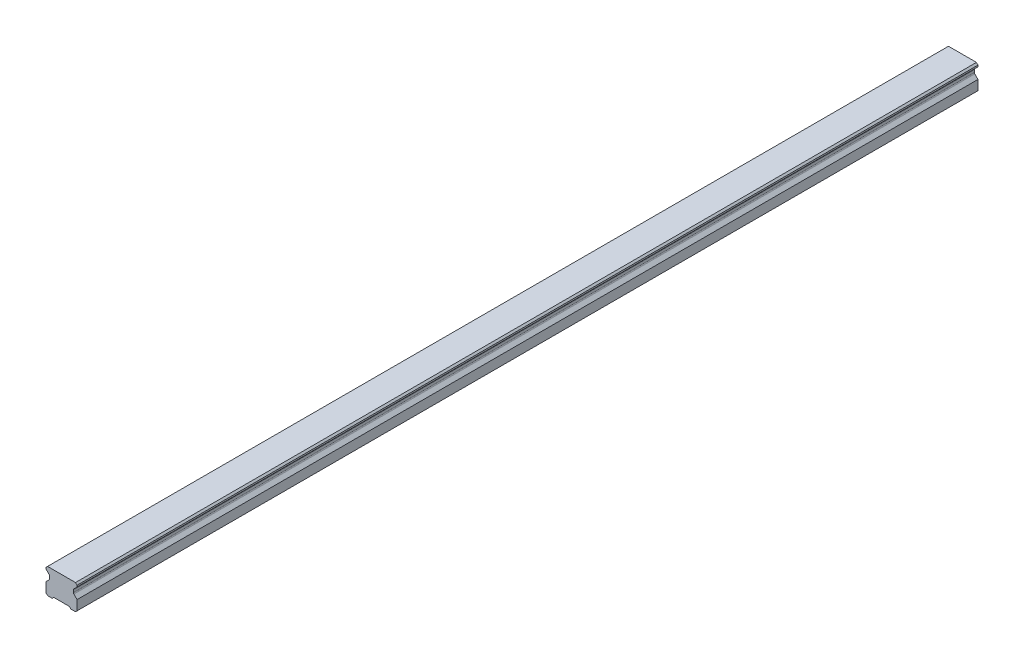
ISO-10303-21;
HEADER;
FILE_DESCRIPTION(('STEP AP214'),'2;1');
FILE_NAME('part.step','',(''),(''),'','','');
FILE_SCHEMA(('AUTOMOTIVE_DESIGN { 1 0 10303 214 1 1 1 1 }'));
ENDSEC;
DATA;
#1=APPLICATION_CONTEXT('core data for automotive mechanical design processes');
#2=APPLICATION_PROTOCOL_DEFINITION('international standard','automotive_design',2000,#1);
#3=PRODUCT_CONTEXT('',#1,'mechanical');
#4=PRODUCT('Part','Part','',(#3));
#5=PRODUCT_RELATED_PRODUCT_CATEGORY('part','',(#4));
#6=PRODUCT_DEFINITION_FORMATION('','',#4);
#7=PRODUCT_DEFINITION_CONTEXT('part definition',#1,'design');
#8=PRODUCT_DEFINITION('design','',#6,#7);
#9=PRODUCT_DEFINITION_SHAPE('','',#8);
#10=(LENGTH_UNIT() NAMED_UNIT(*) SI_UNIT(.MILLI.,.METRE.));
#11=(NAMED_UNIT(*) PLANE_ANGLE_UNIT() SI_UNIT($,.RADIAN.));
#12=(NAMED_UNIT(*) SI_UNIT($,.STERADIAN.) SOLID_ANGLE_UNIT());
#13=UNCERTAINTY_MEASURE_WITH_UNIT(LENGTH_MEASURE(1.E-05),#10,'distance_accuracy_value','');
#14=(GEOMETRIC_REPRESENTATION_CONTEXT(3) GLOBAL_UNCERTAINTY_ASSIGNED_CONTEXT((#13)) GLOBAL_UNIT_ASSIGNED_CONTEXT((#10,
#11,#12)) REPRESENTATION_CONTEXT('',''));
#15=CARTESIAN_POINT('',(0.,0.,0.));
#16=DIRECTION('',(0.,0.,1.));
#17=DIRECTION('',(1.,0.,0.));
#18=AXIS2_PLACEMENT_3D('',#15,#16,#17);
#19=CARTESIAN_POINT('',(0.,11.,-270.));
#20=DIRECTION('',(0.,-1.,0.));
#21=DIRECTION('',(0.,0.,-1.));
#22=AXIS2_PLACEMENT_3D('',#19,#20,#21);
#23=PLANE('',#22);
#24=CARTESIAN_POINT('',(0.,11.,-270.));
#25=DIRECTION('',(0.,-1.,0.));
#26=DIRECTION('',(0.,0.,-1.));
#27=AXIS2_PLACEMENT_3D('',#24,#25,#26);
#28=CIRCLE('',#27,2.5);
#29=CARTESIAN_POINT('',(0.,11.,-272.5));
#30=VERTEX_POINT('',#29);
#31=EDGE_CURVE('E42',#30,#30,#28,.T.);
#32=ORIENTED_EDGE('',*,*,#31,.F.);
#33=EDGE_LOOP('',(#32));
#34=FACE_BOUND('',#33,.T.);
#35=CARTESIAN_POINT('',(0.,11.,-270.));
#36=DIRECTION('',(0.,-1.,0.));
#37=DIRECTION('',(0.,0.,-1.));
#38=AXIS2_PLACEMENT_3D('',#35,#36,#37);
#39=CIRCLE('',#38,3.);
#40=CARTESIAN_POINT('',(0.,11.,-273.));
#41=VERTEX_POINT('',#40);
#42=EDGE_CURVE('E11',#41,#41,#39,.T.);
#43=ORIENTED_EDGE('',*,*,#42,.T.);
#44=EDGE_LOOP('',(#43));
#45=FACE_BOUND('',#44,.T.);
#46=ADVANCED_FACE('F39',(#34,#45),#23,.T.);
#47=CARTESIAN_POINT('',(0.,11.,-270.));
#48=DIRECTION('',(0.,-1.,0.));
#49=DIRECTION('',(0.,0.,-1.));
#50=AXIS2_PLACEMENT_3D('',#47,#48,#49);
#51=CYLINDRICAL_SURFACE('',#50,3.);
#52=ORIENTED_EDGE('',*,*,#42,.F.);
#53=EDGE_LOOP('',(#52));
#54=FACE_BOUND('',#53,.T.);
#55=CARTESIAN_POINT('',(0.,1.,-270.));
#56=DIRECTION('',(0.,-1.,0.));
#57=DIRECTION('',(0.,0.,-1.));
#58=AXIS2_PLACEMENT_3D('',#55,#56,#57);
#59=CIRCLE('',#58,3.);
#60=CARTESIAN_POINT('',(0.,1.,-273.));
#61=VERTEX_POINT('',#60);
#62=EDGE_CURVE('E48',#61,#61,#59,.T.);
#63=ORIENTED_EDGE('',*,*,#62,.T.);
#64=EDGE_LOOP('',(#63));
#65=FACE_BOUND('',#64,.T.);
#66=ADVANCED_FACE('F633',(#54,#65),#51,.F.);
#67=CARTESIAN_POINT('',(0.,11.,-210.));
#68=DIRECTION('',(0.,-1.,0.));
#69=DIRECTION('',(0.,0.,-1.));
#70=AXIS2_PLACEMENT_3D('',#67,#68,#69);
#71=PLANE('',#70);
#72=CARTESIAN_POINT('',(0.,11.,-210.));
#73=DIRECTION('',(0.,-1.,0.));
#74=DIRECTION('',(0.,0.,-1.));
#75=AXIS2_PLACEMENT_3D('',#72,#73,#74);
#76=CIRCLE('',#75,2.5);
#77=CARTESIAN_POINT('',(0.,11.,-212.5));
#78=VERTEX_POINT('',#77);
#79=EDGE_CURVE('E619',#78,#78,#76,.T.);
#80=ORIENTED_EDGE('',*,*,#79,.F.);
#81=EDGE_LOOP('',(#80));
#82=FACE_BOUND('',#81,.T.);
#83=CARTESIAN_POINT('',(0.,11.,-210.));
#84=DIRECTION('',(0.,-1.,0.));
#85=DIRECTION('',(0.,0.,-1.));
#86=AXIS2_PLACEMENT_3D('',#83,#84,#85);
#87=CIRCLE('',#86,3.);
#88=CARTESIAN_POINT('',(0.,11.,-213.));
#89=VERTEX_POINT('',#88);
#90=EDGE_CURVE('E590',#89,#89,#87,.T.);
#91=ORIENTED_EDGE('',*,*,#90,.T.);
#92=EDGE_LOOP('',(#91));
#93=FACE_BOUND('',#92,.T.);
#94=ADVANCED_FACE('F638',(#82,#93),#71,.T.);
#95=CARTESIAN_POINT('',(0.,11.,-210.));
#96=DIRECTION('',(0.,-1.,0.));
#97=DIRECTION('',(0.,0.,-1.));
#98=AXIS2_PLACEMENT_3D('',#95,#96,#97);
#99=CYLINDRICAL_SURFACE('',#98,3.);
#100=ORIENTED_EDGE('',*,*,#90,.F.);
#101=EDGE_LOOP('',(#100));
#102=FACE_BOUND('',#101,.T.);
#103=CARTESIAN_POINT('',(0.,1.,-210.));
#104=DIRECTION('',(0.,-1.,0.));
#105=DIRECTION('',(0.,0.,-1.));
#106=AXIS2_PLACEMENT_3D('',#103,#104,#105);
#107=CIRCLE('',#106,3.);
#108=CARTESIAN_POINT('',(0.,1.,-213.));
#109=VERTEX_POINT('',#108);
#110=EDGE_CURVE('E586',#109,#109,#107,.T.);
#111=ORIENTED_EDGE('',*,*,#110,.T.);
#112=EDGE_LOOP('',(#111));
#113=FACE_BOUND('',#112,.T.);
#114=ADVANCED_FACE('F789',(#102,#113),#99,.F.);
#115=CARTESIAN_POINT('',(0.,11.,-150.));
#116=DIRECTION('',(0.,-1.,0.));
#117=DIRECTION('',(0.,0.,-1.));
#118=AXIS2_PLACEMENT_3D('',#115,#116,#117);
#119=PLANE('',#118);
#120=CARTESIAN_POINT('',(0.,11.,-150.));
#121=DIRECTION('',(0.,-1.,0.));
#122=DIRECTION('',(0.,0.,-1.));
#123=AXIS2_PLACEMENT_3D('',#120,#121,#122);
#124=CIRCLE('',#123,2.5);
#125=CARTESIAN_POINT('',(0.,11.,-152.5));
#126=VERTEX_POINT('',#125);
#127=EDGE_CURVE('E616',#126,#126,#124,.T.);
#128=ORIENTED_EDGE('',*,*,#127,.F.);
#129=EDGE_LOOP('',(#128));
#130=FACE_BOUND('',#129,.T.);
#131=CARTESIAN_POINT('',(0.,11.,-150.));
#132=DIRECTION('',(0.,-1.,0.));
#133=DIRECTION('',(0.,0.,-1.));
#134=AXIS2_PLACEMENT_3D('',#131,#132,#133);
#135=CIRCLE('',#134,3.);
#136=CARTESIAN_POINT('',(0.,11.,-153.));
#137=VERTEX_POINT('',#136);
#138=EDGE_CURVE('E582',#137,#137,#135,.T.);
#139=ORIENTED_EDGE('',*,*,#138,.T.);
#140=EDGE_LOOP('',(#139));
#141=FACE_BOUND('',#140,.T.);
#142=ADVANCED_FACE('F785',(#130,#141),#119,.T.);
#143=CARTESIAN_POINT('',(0.,11.,-150.));
#144=DIRECTION('',(0.,-1.,0.));
#145=DIRECTION('',(0.,0.,-1.));
#146=AXIS2_PLACEMENT_3D('',#143,#144,#145);
#147=CYLINDRICAL_SURFACE('',#146,3.);
#148=ORIENTED_EDGE('',*,*,#138,.F.);
#149=EDGE_LOOP('',(#148));
#150=FACE_BOUND('',#149,.T.);
#151=CARTESIAN_POINT('',(0.,1.,-150.));
#152=DIRECTION('',(0.,-1.,0.));
#153=DIRECTION('',(0.,0.,-1.));
#154=AXIS2_PLACEMENT_3D('',#151,#152,#153);
#155=CIRCLE('',#154,3.);
#156=CARTESIAN_POINT('',(0.,1.,-153.));
#157=VERTEX_POINT('',#156);
#158=EDGE_CURVE('E579',#157,#157,#155,.T.);
#159=ORIENTED_EDGE('',*,*,#158,.T.);
#160=EDGE_LOOP('',(#159));
#161=FACE_BOUND('',#160,.T.);
#162=ADVANCED_FACE('F781',(#150,#161),#147,.F.);
#163=CARTESIAN_POINT('',(0.,11.,-90.));
#164=DIRECTION('',(0.,-1.,0.));
#165=DIRECTION('',(0.,0.,-1.));
#166=AXIS2_PLACEMENT_3D('',#163,#164,#165);
#167=PLANE('',#166);
#168=CARTESIAN_POINT('',(0.,11.,-90.));
#169=DIRECTION('',(0.,-1.,0.));
#170=DIRECTION('',(0.,0.,-1.));
#171=AXIS2_PLACEMENT_3D('',#168,#169,#170);
#172=CIRCLE('',#171,2.5);
#173=CARTESIAN_POINT('',(0.,11.,-92.5));
#174=VERTEX_POINT('',#173);
#175=EDGE_CURVE('E612',#174,#174,#172,.T.);
#176=ORIENTED_EDGE('',*,*,#175,.F.);
#177=EDGE_LOOP('',(#176));
#178=FACE_BOUND('',#177,.T.);
#179=CARTESIAN_POINT('',(0.,11.,-90.));
#180=DIRECTION('',(0.,-1.,0.));
#181=DIRECTION('',(0.,0.,-1.));
#182=AXIS2_PLACEMENT_3D('',#179,#180,#181);
#183=CIRCLE('',#182,3.);
#184=CARTESIAN_POINT('',(0.,11.,-93.));
#185=VERTEX_POINT('',#184);
#186=EDGE_CURVE('E575',#185,#185,#183,.T.);
#187=ORIENTED_EDGE('',*,*,#186,.T.);
#188=EDGE_LOOP('',(#187));
#189=FACE_BOUND('',#188,.T.);
#190=ADVANCED_FACE('F777',(#178,#189),#167,.T.);
#191=CARTESIAN_POINT('',(0.,11.,-90.));
#192=DIRECTION('',(0.,-1.,0.));
#193=DIRECTION('',(0.,0.,-1.));
#194=AXIS2_PLACEMENT_3D('',#191,#192,#193);
#195=CYLINDRICAL_SURFACE('',#194,3.);
#196=ORIENTED_EDGE('',*,*,#186,.F.);
#197=EDGE_LOOP('',(#196));
#198=FACE_BOUND('',#197,.T.);
#199=CARTESIAN_POINT('',(0.,1.,-90.));
#200=DIRECTION('',(0.,-1.,0.));
#201=DIRECTION('',(0.,0.,-1.));
#202=AXIS2_PLACEMENT_3D('',#199,#200,#201);
#203=CIRCLE('',#202,3.);
#204=CARTESIAN_POINT('',(0.,1.,-93.));
#205=VERTEX_POINT('',#204);
#206=EDGE_CURVE('E571',#205,#205,#203,.T.);
#207=ORIENTED_EDGE('',*,*,#206,.T.);
#208=EDGE_LOOP('',(#207));
#209=FACE_BOUND('',#208,.T.);
#210=ADVANCED_FACE('F773',(#198,#209),#195,.F.);
#211=CARTESIAN_POINT('',(0.,11.,-30.));
#212=DIRECTION('',(0.,-1.,0.));
#213=DIRECTION('',(0.,0.,-1.));
#214=AXIS2_PLACEMENT_3D('',#211,#212,#213);
#215=PLANE('',#214);
#216=CARTESIAN_POINT('',(0.,11.,-30.));
#217=DIRECTION('',(0.,-1.,0.));
#218=DIRECTION('',(0.,0.,-1.));
#219=AXIS2_PLACEMENT_3D('',#216,#217,#218);
#220=CIRCLE('',#219,2.5);
#221=CARTESIAN_POINT('',(0.,11.,-32.5));
#222=VERTEX_POINT('',#221);
#223=EDGE_CURVE('E608',#222,#222,#220,.T.);
#224=ORIENTED_EDGE('',*,*,#223,.F.);
#225=EDGE_LOOP('',(#224));
#226=FACE_BOUND('',#225,.T.);
#227=CARTESIAN_POINT('',(0.,11.,-30.));
#228=DIRECTION('',(0.,-1.,0.));
#229=DIRECTION('',(0.,0.,-1.));
#230=AXIS2_PLACEMENT_3D('',#227,#228,#229);
#231=CIRCLE('',#230,3.);
#232=CARTESIAN_POINT('',(0.,11.,-33.));
#233=VERTEX_POINT('',#232);
#234=EDGE_CURVE('E567',#233,#233,#231,.T.);
#235=ORIENTED_EDGE('',*,*,#234,.T.);
#236=EDGE_LOOP('',(#235));
#237=FACE_BOUND('',#236,.T.);
#238=ADVANCED_FACE('F769',(#226,#237),#215,.T.);
#239=CARTESIAN_POINT('',(0.,11.,-30.));
#240=DIRECTION('',(0.,-1.,0.));
#241=DIRECTION('',(0.,0.,-1.));
#242=AXIS2_PLACEMENT_3D('',#239,#240,#241);
#243=CYLINDRICAL_SURFACE('',#242,3.);
#244=ORIENTED_EDGE('',*,*,#234,.F.);
#245=EDGE_LOOP('',(#244));
#246=FACE_BOUND('',#245,.T.);
#247=CARTESIAN_POINT('',(0.,1.,-30.));
#248=DIRECTION('',(0.,-1.,0.));
#249=DIRECTION('',(0.,0.,-1.));
#250=AXIS2_PLACEMENT_3D('',#247,#248,#249);
#251=CIRCLE('',#250,3.);
#252=CARTESIAN_POINT('',(0.,1.,-33.));
#253=VERTEX_POINT('',#252);
#254=EDGE_CURVE('E563',#253,#253,#251,.T.);
#255=ORIENTED_EDGE('',*,*,#254,.T.);
#256=EDGE_LOOP('',(#255));
#257=FACE_BOUND('',#256,.T.);
#258=ADVANCED_FACE('F765',(#246,#257),#243,.F.);
#259=CARTESIAN_POINT('',(0.,11.,30.));
#260=DIRECTION('',(0.,-1.,0.));
#261=DIRECTION('',(0.,0.,-1.));
#262=AXIS2_PLACEMENT_3D('',#259,#260,#261);
#263=PLANE('',#262);
#264=CARTESIAN_POINT('',(0.,11.,30.));
#265=DIRECTION('',(0.,-1.,0.));
#266=DIRECTION('',(0.,0.,-1.));
#267=AXIS2_PLACEMENT_3D('',#264,#265,#266);
#268=CIRCLE('',#267,2.5);
#269=CARTESIAN_POINT('',(0.,11.,27.5));
#270=VERTEX_POINT('',#269);
#271=EDGE_CURVE('E604',#270,#270,#268,.T.);
#272=ORIENTED_EDGE('',*,*,#271,.F.);
#273=EDGE_LOOP('',(#272));
#274=FACE_BOUND('',#273,.T.);
#275=CARTESIAN_POINT('',(0.,11.,30.));
#276=DIRECTION('',(0.,-1.,0.));
#277=DIRECTION('',(0.,0.,-1.));
#278=AXIS2_PLACEMENT_3D('',#275,#276,#277);
#279=CIRCLE('',#278,3.);
#280=CARTESIAN_POINT('',(0.,11.,27.));
#281=VERTEX_POINT('',#280);
#282=EDGE_CURVE('E559',#281,#281,#279,.T.);
#283=ORIENTED_EDGE('',*,*,#282,.T.);
#284=EDGE_LOOP('',(#283));
#285=FACE_BOUND('',#284,.T.);
#286=ADVANCED_FACE('F761',(#274,#285),#263,.T.);
#287=CARTESIAN_POINT('',(0.,11.,30.));
#288=DIRECTION('',(0.,-1.,0.));
#289=DIRECTION('',(0.,0.,-1.));
#290=AXIS2_PLACEMENT_3D('',#287,#288,#289);
#291=CYLINDRICAL_SURFACE('',#290,3.);
#292=ORIENTED_EDGE('',*,*,#282,.F.);
#293=EDGE_LOOP('',(#292));
#294=FACE_BOUND('',#293,.T.);
#295=CARTESIAN_POINT('',(0.,1.,30.));
#296=DIRECTION('',(0.,-1.,0.));
#297=DIRECTION('',(0.,0.,-1.));
#298=AXIS2_PLACEMENT_3D('',#295,#296,#297);
#299=CIRCLE('',#298,3.);
#300=CARTESIAN_POINT('',(0.,1.,27.));
#301=VERTEX_POINT('',#300);
#302=EDGE_CURVE('E555',#301,#301,#299,.T.);
#303=ORIENTED_EDGE('',*,*,#302,.T.);
#304=EDGE_LOOP('',(#303));
#305=FACE_BOUND('',#304,.T.);
#306=ADVANCED_FACE('F757',(#294,#305),#291,.F.);
#307=CARTESIAN_POINT('',(0.,11.,90.));
#308=DIRECTION('',(0.,-1.,0.));
#309=DIRECTION('',(0.,0.,-1.));
#310=AXIS2_PLACEMENT_3D('',#307,#308,#309);
#311=PLANE('',#310);
#312=CARTESIAN_POINT('',(0.,11.,90.));
#313=DIRECTION('',(0.,-1.,0.));
#314=DIRECTION('',(0.,0.,-1.));
#315=AXIS2_PLACEMENT_3D('',#312,#313,#314);
#316=CIRCLE('',#315,2.5);
#317=CARTESIAN_POINT('',(0.,11.,87.5));
#318=VERTEX_POINT('',#317);
#319=EDGE_CURVE('E600',#318,#318,#316,.T.);
#320=ORIENTED_EDGE('',*,*,#319,.F.);
#321=EDGE_LOOP('',(#320));
#322=FACE_BOUND('',#321,.T.);
#323=CARTESIAN_POINT('',(0.,11.,90.));
#324=DIRECTION('',(0.,-1.,0.));
#325=DIRECTION('',(0.,0.,-1.));
#326=AXIS2_PLACEMENT_3D('',#323,#324,#325);
#327=CIRCLE('',#326,3.);
#328=CARTESIAN_POINT('',(0.,11.,87.));
#329=VERTEX_POINT('',#328);
#330=EDGE_CURVE('E551',#329,#329,#327,.T.);
#331=ORIENTED_EDGE('',*,*,#330,.T.);
#332=EDGE_LOOP('',(#331));
#333=FACE_BOUND('',#332,.T.);
#334=ADVANCED_FACE('F753',(#322,#333),#311,.T.);
#335=CARTESIAN_POINT('',(0.,11.,90.));
#336=DIRECTION('',(0.,-1.,0.));
#337=DIRECTION('',(0.,0.,-1.));
#338=AXIS2_PLACEMENT_3D('',#335,#336,#337);
#339=CYLINDRICAL_SURFACE('',#338,3.);
#340=ORIENTED_EDGE('',*,*,#330,.F.);
#341=EDGE_LOOP('',(#340));
#342=FACE_BOUND('',#341,.T.);
#343=CARTESIAN_POINT('',(0.,1.,90.));
#344=DIRECTION('',(0.,-1.,0.));
#345=DIRECTION('',(0.,0.,-1.));
#346=AXIS2_PLACEMENT_3D('',#343,#344,#345);
#347=CIRCLE('',#346,3.);
#348=CARTESIAN_POINT('',(0.,1.,87.));
#349=VERTEX_POINT('',#348);
#350=EDGE_CURVE('E547',#349,#349,#347,.T.);
#351=ORIENTED_EDGE('',*,*,#350,.T.);
#352=EDGE_LOOP('',(#351));
#353=FACE_BOUND('',#352,.T.);
#354=ADVANCED_FACE('F749',(#342,#353),#339,.F.);
#355=CARTESIAN_POINT('',(0.,11.,150.));
#356=DIRECTION('',(0.,-1.,0.));
#357=DIRECTION('',(0.,0.,-1.));
#358=AXIS2_PLACEMENT_3D('',#355,#356,#357);
#359=PLANE('',#358);
#360=CARTESIAN_POINT('',(0.,11.,150.));
#361=DIRECTION('',(0.,-1.,0.));
#362=DIRECTION('',(0.,0.,-1.));
#363=AXIS2_PLACEMENT_3D('',#360,#361,#362);
#364=CIRCLE('',#363,2.5);
#365=CARTESIAN_POINT('',(0.,11.,147.5));
#366=VERTEX_POINT('',#365);
#367=EDGE_CURVE('E248',#366,#366,#364,.T.);
#368=ORIENTED_EDGE('',*,*,#367,.F.);
#369=EDGE_LOOP('',(#368));
#370=FACE_BOUND('',#369,.T.);
#371=CARTESIAN_POINT('',(0.,11.,150.));
#372=DIRECTION('',(0.,-1.,0.));
#373=DIRECTION('',(0.,0.,-1.));
#374=AXIS2_PLACEMENT_3D('',#371,#372,#373);
#375=CIRCLE('',#374,3.);
#376=CARTESIAN_POINT('',(0.,11.,147.));
#377=VERTEX_POINT('',#376);
#378=EDGE_CURVE('E543',#377,#377,#375,.T.);
#379=ORIENTED_EDGE('',*,*,#378,.T.);
#380=EDGE_LOOP('',(#379));
#381=FACE_BOUND('',#380,.T.);
#382=ADVANCED_FACE('F745',(#370,#381),#359,.T.);
#383=CARTESIAN_POINT('',(0.,11.,150.));
#384=DIRECTION('',(0.,-1.,0.));
#385=DIRECTION('',(0.,0.,-1.));
#386=AXIS2_PLACEMENT_3D('',#383,#384,#385);
#387=CYLINDRICAL_SURFACE('',#386,3.);
#388=ORIENTED_EDGE('',*,*,#378,.F.);
#389=EDGE_LOOP('',(#388));
#390=FACE_BOUND('',#389,.T.);
#391=CARTESIAN_POINT('',(0.,1.,150.));
#392=DIRECTION('',(0.,-1.,0.));
#393=DIRECTION('',(0.,0.,-1.));
#394=AXIS2_PLACEMENT_3D('',#391,#392,#393);
#395=CIRCLE('',#394,3.);
#396=CARTESIAN_POINT('',(0.,1.,147.));
#397=VERTEX_POINT('',#396);
#398=EDGE_CURVE('E539',#397,#397,#395,.T.);
#399=ORIENTED_EDGE('',*,*,#398,.T.);
#400=EDGE_LOOP('',(#399));
#401=FACE_BOUND('',#400,.T.);
#402=ADVANCED_FACE('F742',(#390,#401),#387,.F.);
#403=CARTESIAN_POINT('',(10.,0.,290.));
#404=DIRECTION('',(0.,1.,0.));
#405=DIRECTION('',(-1.,0.,0.));
#406=AXIS2_PLACEMENT_3D('',#403,#404,#405);
#407=PLANE('',#406);
#408=DIRECTION('',(1.,0.,0.));
#409=VECTOR('',#408,1.);
#410=CARTESIAN_POINT('',(10.,0.,-290.));
#411=LINE('',#410,#409);
#412=CARTESIAN_POINT('',(-8.99999999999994,0.,-290.));
#413=VERTEX_POINT('',#412);
#414=CARTESIAN_POINT('',(-6.,0.,-290.));
#415=VERTEX_POINT('',#414);
#416=EDGE_CURVE('E423',#413,#415,#411,.T.);
#417=ORIENTED_EDGE('',*,*,#416,.T.);
#418=DIRECTION('',(0.,0.,1.));
#419=VECTOR('',#418,1.);
#420=CARTESIAN_POINT('',(-6.,0.,-290.));
#421=LINE('',#420,#419);
#422=CARTESIAN_POINT('',(-6.,0.,290.));
#423=VERTEX_POINT('',#422);
#424=EDGE_CURVE('E328',#415,#423,#421,.T.);
#425=ORIENTED_EDGE('',*,*,#424,.T.);
#426=DIRECTION('',(1.,0.,0.));
#427=VECTOR('',#426,1.);
#428=CARTESIAN_POINT('',(10.,0.,290.));
#429=LINE('',#428,#427);
#430=CARTESIAN_POINT('',(-8.99999999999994,0.,290.));
#431=VERTEX_POINT('',#430);
#432=EDGE_CURVE('E404',#431,#423,#429,.T.);
#433=ORIENTED_EDGE('',*,*,#432,.F.);
#434=DIRECTION('',(0.,0.,-1.));
#435=VECTOR('',#434,1.);
#436=CARTESIAN_POINT('',(-8.99999999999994,0.,290.));
#437=LINE('',#436,#435);
#438=EDGE_CURVE('E475',#431,#413,#437,.T.);
#439=ORIENTED_EDGE('',*,*,#438,.T.);
#440=EDGE_LOOP('',(#417,#425,#433,#439));
#441=FACE_BOUND('',#440,.T.);
#442=ADVANCED_FACE('F707',(#441),#407,.F.);
#443=CARTESIAN_POINT('',(-10.,16.3,290.));
#444=DIRECTION('',(1.,0.,0.));
#445=DIRECTION('',(0.,1.,0.));
#446=AXIS2_PLACEMENT_3D('',#443,#444,#445);
#447=PLANE('',#446);
#448=DIRECTION('',(0.,-1.,0.));
#449=VECTOR('',#448,1.);
#450=CARTESIAN_POINT('',(-10.,16.3,290.));
#451=LINE('',#450,#449);
#452=CARTESIAN_POINT('',(-10.,15.2999999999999,290.));
#453=VERTEX_POINT('',#452);
#454=CARTESIAN_POINT('',(-10.,14.3,290.));
#455=VERTEX_POINT('',#454);
#456=EDGE_CURVE('E398',#453,#455,#451,.T.);
#457=ORIENTED_EDGE('',*,*,#456,.F.);
#458=DIRECTION('',(0.,0.,-1.));
#459=VECTOR('',#458,1.);
#460=CARTESIAN_POINT('',(-10.,15.2999999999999,290.));
#461=LINE('',#460,#459);
#462=CARTESIAN_POINT('',(-10.,15.2999999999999,-290.));
#463=VERTEX_POINT('',#462);
#464=EDGE_CURVE('E417',#453,#463,#461,.T.);
#465=ORIENTED_EDGE('',*,*,#464,.T.);
#466=DIRECTION('',(0.,-1.,0.));
#467=VECTOR('',#466,1.);
#468=CARTESIAN_POINT('',(-10.,16.3,-290.));
#469=LINE('',#468,#467);
#470=CARTESIAN_POINT('',(-10.,14.3,-290.));
#471=VERTEX_POINT('',#470);
#472=EDGE_CURVE('E418',#463,#471,#469,.T.);
#473=ORIENTED_EDGE('',*,*,#472,.T.);
#474=DIRECTION('',(0.,0.,1.));
#475=VECTOR('',#474,1.);
#476=CARTESIAN_POINT('',(-10.,14.3,-290.));
#477=LINE('',#476,#475);
#478=EDGE_CURVE('E352',#471,#455,#477,.T.);
#479=ORIENTED_EDGE('',*,*,#478,.T.);
#480=EDGE_LOOP('',(#457,#465,#473,#479));
#481=FACE_BOUND('',#480,.T.);
#482=ADVANCED_FACE('F711',(#481),#447,.F.);
#483=CARTESIAN_POINT('',(10.,16.3,290.));
#484=DIRECTION('',(-1.,0.,0.));
#485=DIRECTION('',(0.,-1.,0.));
#486=AXIS2_PLACEMENT_3D('',#483,#484,#485);
#487=PLANE('',#486);
#488=DIRECTION('',(0.,1.,0.));
#489=VECTOR('',#488,1.);
#490=CARTESIAN_POINT('',(10.,16.3,290.));
#491=LINE('',#490,#489);
#492=CARTESIAN_POINT('',(10.,0.999999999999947,290.));
#493=VERTEX_POINT('',#492);
#494=CARTESIAN_POINT('',(10.,7.3,290.));
#495=VERTEX_POINT('',#494);
#496=EDGE_CURVE('E409',#493,#495,#491,.T.);
#497=ORIENTED_EDGE('',*,*,#496,.F.);
#498=DIRECTION('',(0.,0.,-1.));
#499=VECTOR('',#498,1.);
#500=CARTESIAN_POINT('',(10.,0.999999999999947,290.));
#501=LINE('',#500,#499);
#502=CARTESIAN_POINT('',(10.,0.999999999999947,-290.));
#503=VERTEX_POINT('',#502);
#504=EDGE_CURVE('E482',#493,#503,#501,.T.);
#505=ORIENTED_EDGE('',*,*,#504,.T.);
#506=DIRECTION('',(0.,1.,0.));
#507=VECTOR('',#506,1.);
#508=CARTESIAN_POINT('',(10.,16.3,-290.));
#509=LINE('',#508,#507);
#510=CARTESIAN_POINT('',(10.,7.3,-290.));
#511=VERTEX_POINT('',#510);
#512=EDGE_CURVE('E428',#503,#511,#509,.T.);
#513=ORIENTED_EDGE('',*,*,#512,.T.);
#514=DIRECTION('',(0.,0.,1.));
#515=VECTOR('',#514,1.);
#516=CARTESIAN_POINT('',(10.,7.3,-290.));
#517=LINE('',#516,#515);
#518=EDGE_CURVE('E383',#511,#495,#517,.T.);
#519=ORIENTED_EDGE('',*,*,#518,.T.);
#520=EDGE_LOOP('',(#497,#505,#513,#519));
#521=FACE_BOUND('',#520,.T.);
#522=ADVANCED_FACE('F702',(#521),#487,.F.);
#523=CARTESIAN_POINT('',(-10.,7.3,-290.));
#524=VERTEX_POINT('',#523);
#525=CARTESIAN_POINT('',(-10.,0.999999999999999,-290.));
#526=VERTEX_POINT('',#525);
#527=EDGE_CURVE('E367',#524,#526,#469,.T.);
#528=ORIENTED_EDGE('',*,*,#527,.T.);
#529=DIRECTION('',(0.,0.,1.));
#530=VECTOR('',#529,1.);
#531=CARTESIAN_POINT('',(-10.,0.999999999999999,290.));
#532=LINE('',#531,#530);
#533=CARTESIAN_POINT('',(-10.,0.999999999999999,290.));
#534=VERTEX_POINT('',#533);
#535=EDGE_CURVE('E479',#526,#534,#532,.T.);
#536=ORIENTED_EDGE('',*,*,#535,.T.);
#537=CARTESIAN_POINT('',(-10.,7.3,290.));
#538=VERTEX_POINT('',#537);
#539=EDGE_CURVE('E403',#538,#534,#451,.T.);
#540=ORIENTED_EDGE('',*,*,#539,.F.);
#541=DIRECTION('',(0.,0.,1.));
#542=VECTOR('',#541,1.);
#543=CARTESIAN_POINT('',(-10.,7.3,-290.));
#544=LINE('',#543,#542);
#545=EDGE_CURVE('E364',#524,#538,#544,.T.);
#546=ORIENTED_EDGE('',*,*,#545,.F.);
#547=EDGE_LOOP('',(#528,#536,#540,#546));
#548=FACE_BOUND('',#547,.T.);
#549=ADVANCED_FACE('F705',(#548),#447,.F.);
#550=CARTESIAN_POINT('',(6.,0.,290.));
#551=VERTEX_POINT('',#550);
#552=CARTESIAN_POINT('',(9.,0.,290.));
#553=VERTEX_POINT('',#552);
#554=EDGE_CURVE('E402',#551,#553,#429,.T.);
#555=ORIENTED_EDGE('',*,*,#554,.F.);
#556=DIRECTION('',(0.,0.,1.));
#557=VECTOR('',#556,1.);
#558=CARTESIAN_POINT('',(6.,0.,-290.));
#559=LINE('',#558,#557);
#560=CARTESIAN_POINT('',(6.,0.,-290.));
#561=VERTEX_POINT('',#560);
#562=EDGE_CURVE('E318',#561,#551,#559,.T.);
#563=ORIENTED_EDGE('',*,*,#562,.F.);
#564=CARTESIAN_POINT('',(9.,0.,-290.));
#565=VERTEX_POINT('',#564);
#566=EDGE_CURVE('E422',#561,#565,#411,.T.);
#567=ORIENTED_EDGE('',*,*,#566,.T.);
#568=DIRECTION('',(0.,0.,1.));
#569=VECTOR('',#568,1.);
#570=CARTESIAN_POINT('',(9.,0.,290.));
#571=LINE('',#570,#569);
#572=EDGE_CURVE('E471',#565,#553,#571,.T.);
#573=ORIENTED_EDGE('',*,*,#572,.T.);
#574=EDGE_LOOP('',(#555,#563,#567,#573));
#575=FACE_BOUND('',#574,.T.);
#576=ADVANCED_FACE('F700',(#575),#407,.F.);
#577=CARTESIAN_POINT('',(10.,14.3,-290.));
#578=VERTEX_POINT('',#577);
#579=CARTESIAN_POINT('',(10.,15.3,-290.));
#580=VERTEX_POINT('',#579);
#581=EDGE_CURVE('E427',#578,#580,#509,.T.);
#582=ORIENTED_EDGE('',*,*,#581,.T.);
#583=DIRECTION('',(0.,0.,1.));
#584=VECTOR('',#583,1.);
#585=CARTESIAN_POINT('',(10.,15.3,290.));
#586=LINE('',#585,#584);
#587=CARTESIAN_POINT('',(10.,15.3,290.));
#588=VERTEX_POINT('',#587);
#589=EDGE_CURVE('E486',#580,#588,#586,.T.);
#590=ORIENTED_EDGE('',*,*,#589,.T.);
#591=CARTESIAN_POINT('',(10.,14.3,290.));
#592=VERTEX_POINT('',#591);
#593=EDGE_CURVE('E408',#592,#588,#491,.T.);
#594=ORIENTED_EDGE('',*,*,#593,.F.);
#595=DIRECTION('',(0.,0.,1.));
#596=VECTOR('',#595,1.);
#597=CARTESIAN_POINT('',(10.,14.3,-290.));
#598=LINE('',#597,#596);
#599=EDGE_CURVE('E357',#578,#592,#598,.T.);
#600=ORIENTED_EDGE('',*,*,#599,.F.);
#601=EDGE_LOOP('',(#582,#590,#594,#600));
#602=FACE_BOUND('',#601,.T.);
#603=ADVANCED_FACE('F696',(#602),#487,.F.);
#604=CARTESIAN_POINT('',(10.,16.3,290.));
#605=DIRECTION('',(0.,-1.,0.));
#606=DIRECTION('',(0.,0.,-1.));
#607=AXIS2_PLACEMENT_3D('',#604,#605,#606);
#608=PLANE('',#607);
#609=DIRECTION('',(-1.,0.,0.));
#610=VECTOR('',#609,1.);
#611=CARTESIAN_POINT('',(10.,16.3,-290.));
#612=LINE('',#611,#610);
#613=CARTESIAN_POINT('',(8.99999999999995,16.3,-290.));
#614=VERTEX_POINT('',#613);
#615=CARTESIAN_POINT('',(-9.,16.3,-290.));
#616=VERTEX_POINT('',#615);
#617=EDGE_CURVE('E432',#614,#616,#612,.T.);
#618=ORIENTED_EDGE('',*,*,#617,.T.);
#619=DIRECTION('',(0.,0.,1.));
#620=VECTOR('',#619,1.);
#621=CARTESIAN_POINT('',(-9.,16.3,290.));
#622=LINE('',#621,#620);
#623=CARTESIAN_POINT('',(-9.,16.3,290.));
#624=VERTEX_POINT('',#623);
#625=EDGE_CURVE('E456',#616,#624,#622,.T.);
#626=ORIENTED_EDGE('',*,*,#625,.T.);
#627=DIRECTION('',(-1.,0.,0.));
#628=VECTOR('',#627,1.);
#629=CARTESIAN_POINT('',(10.,16.3,290.));
#630=LINE('',#629,#628);
#631=CARTESIAN_POINT('',(8.99999999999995,16.3,290.));
#632=VERTEX_POINT('',#631);
#633=EDGE_CURVE('E413',#632,#624,#630,.T.);
#634=ORIENTED_EDGE('',*,*,#633,.F.);
#635=DIRECTION('',(0.,0.,-1.));
#636=VECTOR('',#635,1.);
#637=CARTESIAN_POINT('',(8.99999999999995,16.3,290.));
#638=LINE('',#637,#636);
#639=EDGE_CURVE('E452',#632,#614,#638,.T.);
#640=ORIENTED_EDGE('',*,*,#639,.T.);
#641=EDGE_LOOP('',(#618,#626,#634,#640));
#642=FACE_BOUND('',#641,.T.);
#643=ADVANCED_FACE('F690',(#642),#608,.F.);
#644=CARTESIAN_POINT('',(0.,0.,290.));
#645=DIRECTION('',(0.,0.,-1.));
#646=DIRECTION('',(-1.,0.,0.));
#647=AXIS2_PLACEMENT_3D('',#644,#645,#646);
#648=PLANE('',#647);
#649=ORIENTED_EDGE('',*,*,#432,.T.);
#650=DIRECTION('',(-0.707106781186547,-0.707106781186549,0.));
#651=VECTOR('',#650,1.);
#652=CARTESIAN_POINT('',(-6.,0.,290.));
#653=LINE('',#652,#651);
#654=CARTESIAN_POINT('',(-5.,1.,290.));
#655=VERTEX_POINT('',#654);
#656=EDGE_CURVE('E311',#655,#423,#653,.T.);
#657=ORIENTED_EDGE('',*,*,#656,.F.);
#658=DIRECTION('',(-1.,0.,0.));
#659=VECTOR('',#658,1.);
#660=CARTESIAN_POINT('',(-5.,1.,290.));
#661=LINE('',#660,#659);
#662=CARTESIAN_POINT('',(5.,1.,290.));
#663=VERTEX_POINT('',#662);
#664=EDGE_CURVE('E322',#663,#655,#661,.T.);
#665=ORIENTED_EDGE('',*,*,#664,.F.);
#666=DIRECTION('',(-0.707106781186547,0.707106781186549,0.));
#667=VECTOR('',#666,1.);
#668=CARTESIAN_POINT('',(5.,1.,290.));
#669=LINE('',#668,#667);
#670=EDGE_CURVE('E303',#551,#663,#669,.T.);
#671=ORIENTED_EDGE('',*,*,#670,.F.);
#672=ORIENTED_EDGE('',*,*,#554,.T.);
#673=DIRECTION('',(-0.707106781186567,-0.707106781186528,0.));
#674=VECTOR('',#673,1.);
#675=CARTESIAN_POINT('',(10.,0.999999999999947,290.));
#676=LINE('',#675,#674);
#677=EDGE_CURVE('E462',#553,#493,#676,.F.);
#678=ORIENTED_EDGE('',*,*,#677,.T.);
#679=ORIENTED_EDGE('',*,*,#496,.T.);
#680=DIRECTION('',(0.707106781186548,-0.707106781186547,0.));
#681=VECTOR('',#680,1.);
#682=CARTESIAN_POINT('',(10.,7.3,290.));
#683=LINE('',#682,#681);
#684=CARTESIAN_POINT('',(7.95955988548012,9.34044011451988,290.));
#685=VERTEX_POINT('',#684);
#686=EDGE_CURVE('E332',#685,#495,#683,.T.);
#687=ORIENTED_EDGE('',*,*,#686,.F.);
#688=CARTESIAN_POINT('',(8.66666666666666,10.0475468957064,290.));
#689=DIRECTION('',(0.,0.,-1.));
#690=DIRECTION('',(-1.,0.,0.));
#691=AXIS2_PLACEMENT_3D('',#688,#689,#690);
#692=CIRCLE('',#691,1.);
#693=CARTESIAN_POINT('',(7.66666666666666,10.0475468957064,290.));
#694=VERTEX_POINT('',#693);
#695=EDGE_CURVE('E516',#685,#694,#692,.T.);
#696=ORIENTED_EDGE('',*,*,#695,.T.);
#697=DIRECTION('',(0.,-1.,0.));
#698=VECTOR('',#697,1.);
#699=CARTESIAN_POINT('',(7.66666666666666,9.63333333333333,290.));
#700=LINE('',#699,#698);
#701=CARTESIAN_POINT('',(7.66666666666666,11.5524531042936,290.));
#702=VERTEX_POINT('',#701);
#703=EDGE_CURVE('E375',#702,#694,#700,.T.);
#704=ORIENTED_EDGE('',*,*,#703,.F.);
#705=CARTESIAN_POINT('',(8.66666666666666,11.5524531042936,290.));
#706=DIRECTION('',(0.,0.,-1.));
#707=DIRECTION('',(-1.,0.,0.));
#708=AXIS2_PLACEMENT_3D('',#705,#706,#707);
#709=CIRCLE('',#708,1.);
#710=CARTESIAN_POINT('',(7.95955988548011,12.2595598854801,290.));
#711=VERTEX_POINT('',#710);
#712=EDGE_CURVE('E522',#702,#711,#709,.T.);
#713=ORIENTED_EDGE('',*,*,#712,.T.);
#714=DIRECTION('',(-0.707106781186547,-0.707106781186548,0.));
#715=VECTOR('',#714,1.);
#716=CARTESIAN_POINT('',(7.66666666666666,11.9666666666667,290.));
#717=LINE('',#716,#715);
#718=EDGE_CURVE('E386',#592,#711,#717,.T.);
#719=ORIENTED_EDGE('',*,*,#718,.F.);
#720=ORIENTED_EDGE('',*,*,#593,.T.);
#721=DIRECTION('',(0.707106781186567,-0.707106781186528,0.));
#722=VECTOR('',#721,1.);
#723=CARTESIAN_POINT('',(8.99999999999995,16.3,290.));
#724=LINE('',#723,#722);
#725=EDGE_CURVE('E459',#588,#632,#724,.F.);
#726=ORIENTED_EDGE('',*,*,#725,.T.);
#727=ORIENTED_EDGE('',*,*,#633,.T.);
#728=DIRECTION('',(0.707106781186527,0.707106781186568,0.));
#729=VECTOR('',#728,1.);
#730=CARTESIAN_POINT('',(-10.,15.2999999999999,290.));
#731=LINE('',#730,#729);
#732=EDGE_CURVE('E468',#624,#453,#731,.F.);
#733=ORIENTED_EDGE('',*,*,#732,.T.);
#734=ORIENTED_EDGE('',*,*,#456,.T.);
#735=DIRECTION('',(-0.707106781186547,0.707106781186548,0.));
#736=VECTOR('',#735,1.);
#737=CARTESIAN_POINT('',(-7.66666666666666,11.9666666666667,290.));
#738=LINE('',#737,#736);
#739=CARTESIAN_POINT('',(-7.95955988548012,12.2595598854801,290.));
#740=VERTEX_POINT('',#739);
#741=EDGE_CURVE('E353',#740,#455,#738,.T.);
#742=ORIENTED_EDGE('',*,*,#741,.F.);
#743=CARTESIAN_POINT('',(-8.66666666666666,11.5524531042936,290.));
#744=DIRECTION('',(0.,0.,-1.));
#745=DIRECTION('',(-1.,0.,0.));
#746=AXIS2_PLACEMENT_3D('',#743,#744,#745);
#747=CIRCLE('',#746,1.);
#748=CARTESIAN_POINT('',(-7.66666666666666,11.5524531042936,290.));
#749=VERTEX_POINT('',#748);
#750=EDGE_CURVE('E534',#740,#749,#747,.T.);
#751=ORIENTED_EDGE('',*,*,#750,.T.);
#752=DIRECTION('',(0.,1.,0.));
#753=VECTOR('',#752,1.);
#754=CARTESIAN_POINT('',(-7.66666666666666,9.63333333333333,290.));
#755=LINE('',#754,#753);
#756=CARTESIAN_POINT('',(-7.66666666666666,10.0475468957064,290.));
#757=VERTEX_POINT('',#756);
#758=EDGE_CURVE('E345',#757,#749,#755,.T.);
#759=ORIENTED_EDGE('',*,*,#758,.F.);
#760=CARTESIAN_POINT('',(-8.66666666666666,10.0475468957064,290.));
#761=DIRECTION('',(0.,0.,-1.));
#762=DIRECTION('',(-1.,0.,0.));
#763=AXIS2_PLACEMENT_3D('',#760,#761,#762);
#764=CIRCLE('',#763,1.);
#765=CARTESIAN_POINT('',(-7.95955988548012,9.34044011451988,290.));
#766=VERTEX_POINT('',#765);
#767=EDGE_CURVE('E528',#757,#766,#764,.T.);
#768=ORIENTED_EDGE('',*,*,#767,.T.);
#769=DIRECTION('',(0.707106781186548,0.707106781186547,0.));
#770=VECTOR('',#769,1.);
#771=CARTESIAN_POINT('',(-10.,7.3,290.));
#772=LINE('',#771,#770);
#773=EDGE_CURVE('E356',#538,#766,#772,.T.);
#774=ORIENTED_EDGE('',*,*,#773,.F.);
#775=ORIENTED_EDGE('',*,*,#539,.T.);
#776=DIRECTION('',(-0.707106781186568,0.707106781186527,0.));
#777=VECTOR('',#776,1.);
#778=CARTESIAN_POINT('',(-8.99999999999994,0.,290.));
#779=LINE('',#778,#777);
#780=EDGE_CURVE('E465',#534,#431,#779,.F.);
#781=ORIENTED_EDGE('',*,*,#780,.T.);
#782=EDGE_LOOP('',(#649,#657,#665,#671,#672,#678,#679,#687,#696,#704,#713,#719,#720,#726,#727,
#733,#734,#742,#751,#759,#768,#774,#775,#781));
#783=FACE_BOUND('',#782,.T.);
#784=ADVANCED_FACE('F687',(#783),#648,.F.);
#785=CARTESIAN_POINT('',(0.,0.,-290.));
#786=DIRECTION('',(0.,0.,-1.));
#787=DIRECTION('',(-1.,0.,0.));
#788=AXIS2_PLACEMENT_3D('',#785,#786,#787);
#789=PLANE('',#788);
#790=DIRECTION('',(-0.707106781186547,-0.707106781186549,0.));
#791=VECTOR('',#790,1.);
#792=CARTESIAN_POINT('',(-6.,0.,-290.));
#793=LINE('',#792,#791);
#794=CARTESIAN_POINT('',(-5.,1.,-290.));
#795=VERTEX_POINT('',#794);
#796=EDGE_CURVE('E314',#795,#415,#793,.T.);
#797=ORIENTED_EDGE('',*,*,#796,.T.);
#798=ORIENTED_EDGE('',*,*,#416,.F.);
#799=DIRECTION('',(0.707106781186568,-0.707106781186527,0.));
#800=VECTOR('',#799,1.);
#801=CARTESIAN_POINT('',(-4.49999999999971,-4.49999999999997,-290.));
#802=LINE('',#801,#800);
#803=EDGE_CURVE('E446',#413,#526,#802,.F.);
#804=ORIENTED_EDGE('',*,*,#803,.T.);
#805=ORIENTED_EDGE('',*,*,#527,.F.);
#806=DIRECTION('',(0.707106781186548,0.707106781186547,0.));
#807=VECTOR('',#806,1.);
#808=CARTESIAN_POINT('',(-10.,7.3,-290.));
#809=LINE('',#808,#807);
#810=CARTESIAN_POINT('',(-7.95955988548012,9.34044011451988,-290.));
#811=VERTEX_POINT('',#810);
#812=EDGE_CURVE('E344',#524,#811,#809,.T.);
#813=ORIENTED_EDGE('',*,*,#812,.T.);
#814=CARTESIAN_POINT('',(-8.66666666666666,10.0475468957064,-290.));
#815=DIRECTION('',(0.,0.,-1.));
#816=DIRECTION('',(-1.,0.,0.));
#817=AXIS2_PLACEMENT_3D('',#814,#815,#816);
#818=CIRCLE('',#817,1.);
#819=CARTESIAN_POINT('',(-7.66666666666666,10.0475468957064,-290.));
#820=VERTEX_POINT('',#819);
#821=EDGE_CURVE('E531',#811,#820,#818,.F.);
#822=ORIENTED_EDGE('',*,*,#821,.T.);
#823=DIRECTION('',(0.,1.,0.));
#824=VECTOR('',#823,1.);
#825=CARTESIAN_POINT('',(-7.66666666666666,9.63333333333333,-290.));
#826=LINE('',#825,#824);
#827=CARTESIAN_POINT('',(-7.66666666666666,11.5524531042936,-290.));
#828=VERTEX_POINT('',#827);
#829=EDGE_CURVE('E349',#820,#828,#826,.T.);
#830=ORIENTED_EDGE('',*,*,#829,.T.);
#831=CARTESIAN_POINT('',(-8.66666666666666,11.5524531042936,-290.));
#832=DIRECTION('',(0.,0.,-1.));
#833=DIRECTION('',(-1.,0.,0.));
#834=AXIS2_PLACEMENT_3D('',#831,#832,#833);
#835=CIRCLE('',#834,1.);
#836=CARTESIAN_POINT('',(-7.95955988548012,12.2595598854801,-290.));
#837=VERTEX_POINT('',#836);
#838=EDGE_CURVE('E64',#828,#837,#835,.F.);
#839=ORIENTED_EDGE('',*,*,#838,.T.);
#840=DIRECTION('',(-0.707106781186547,0.707106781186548,0.));
#841=VECTOR('',#840,1.);
#842=CARTESIAN_POINT('',(-7.66666666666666,11.9666666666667,-290.));
#843=LINE('',#842,#841);
#844=EDGE_CURVE('E341',#837,#471,#843,.T.);
#845=ORIENTED_EDGE('',*,*,#844,.T.);
#846=ORIENTED_EDGE('',*,*,#472,.F.);
#847=DIRECTION('',(-0.707106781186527,-0.707106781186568,0.));
#848=VECTOR('',#847,1.);
#849=CARTESIAN_POINT('',(-12.6500000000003,12.6499999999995,-290.));
#850=LINE('',#849,#848);
#851=EDGE_CURVE('E449',#463,#616,#850,.F.);
#852=ORIENTED_EDGE('',*,*,#851,.T.);
#853=ORIENTED_EDGE('',*,*,#617,.F.);
#854=DIRECTION('',(-0.707106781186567,0.707106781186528,0.));
#855=VECTOR('',#854,1.);
#856=CARTESIAN_POINT('',(12.6499999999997,12.6500000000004,-290.));
#857=LINE('',#856,#855);
#858=EDGE_CURVE('E439',#614,#580,#857,.F.);
#859=ORIENTED_EDGE('',*,*,#858,.T.);
#860=ORIENTED_EDGE('',*,*,#581,.F.);
#861=DIRECTION('',(-0.707106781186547,-0.707106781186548,0.));
#862=VECTOR('',#861,1.);
#863=CARTESIAN_POINT('',(7.66666666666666,11.9666666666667,-290.));
#864=LINE('',#863,#862);
#865=CARTESIAN_POINT('',(7.95955988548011,12.2595598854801,-290.));
#866=VERTEX_POINT('',#865);
#867=EDGE_CURVE('E374',#578,#866,#864,.T.);
#868=ORIENTED_EDGE('',*,*,#867,.T.);
#869=CARTESIAN_POINT('',(8.66666666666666,11.5524531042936,-290.));
#870=DIRECTION('',(0.,0.,-1.));
#871=DIRECTION('',(-1.,0.,0.));
#872=AXIS2_PLACEMENT_3D('',#869,#870,#871);
#873=CIRCLE('',#872,1.);
#874=CARTESIAN_POINT('',(7.66666666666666,11.5524531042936,-290.));
#875=VERTEX_POINT('',#874);
#876=EDGE_CURVE('E525',#866,#875,#873,.F.);
#877=ORIENTED_EDGE('',*,*,#876,.T.);
#878=DIRECTION('',(0.,-1.,0.));
#879=VECTOR('',#878,1.);
#880=CARTESIAN_POINT('',(7.66666666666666,9.63333333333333,-290.));
#881=LINE('',#880,#879);
#882=CARTESIAN_POINT('',(7.66666666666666,10.0475468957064,-290.));
#883=VERTEX_POINT('',#882);
#884=EDGE_CURVE('E379',#875,#883,#881,.T.);
#885=ORIENTED_EDGE('',*,*,#884,.T.);
#886=CARTESIAN_POINT('',(8.66666666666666,10.0475468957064,-290.));
#887=DIRECTION('',(0.,0.,-1.));
#888=DIRECTION('',(-1.,0.,0.));
#889=AXIS2_PLACEMENT_3D('',#886,#887,#888);
#890=CIRCLE('',#889,1.);
#891=CARTESIAN_POINT('',(7.95955988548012,9.34044011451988,-290.));
#892=VERTEX_POINT('',#891);
#893=EDGE_CURVE('E519',#883,#892,#890,.F.);
#894=ORIENTED_EDGE('',*,*,#893,.T.);
#895=DIRECTION('',(0.707106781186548,-0.707106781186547,0.));
#896=VECTOR('',#895,1.);
#897=CARTESIAN_POINT('',(10.,7.3,-290.));
#898=LINE('',#897,#896);
#899=EDGE_CURVE('E371',#892,#511,#898,.T.);
#900=ORIENTED_EDGE('',*,*,#899,.T.);
#901=ORIENTED_EDGE('',*,*,#512,.F.);
#902=DIRECTION('',(0.707106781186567,0.707106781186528,0.));
#903=VECTOR('',#902,1.);
#904=CARTESIAN_POINT('',(4.49999999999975,-4.5,-290.));
#905=LINE('',#904,#903);
#906=EDGE_CURVE('E442',#503,#565,#905,.F.);
#907=ORIENTED_EDGE('',*,*,#906,.T.);
#908=ORIENTED_EDGE('',*,*,#566,.F.);
#909=DIRECTION('',(-0.707106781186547,0.707106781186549,0.));
#910=VECTOR('',#909,1.);
#911=CARTESIAN_POINT('',(5.,1.,-290.));
#912=LINE('',#911,#910);
#913=CARTESIAN_POINT('',(5.,1.,-290.));
#914=VERTEX_POINT('',#913);
#915=EDGE_CURVE('E307',#561,#914,#912,.T.);
#916=ORIENTED_EDGE('',*,*,#915,.T.);
#917=DIRECTION('',(-1.,0.,0.));
#918=VECTOR('',#917,1.);
#919=CARTESIAN_POINT('',(-5.,1.,-290.));
#920=LINE('',#919,#918);
#921=EDGE_CURVE('E56',#914,#795,#920,.T.);
#922=ORIENTED_EDGE('',*,*,#921,.T.);
#923=EDGE_LOOP('',(#797,#798,#804,#805,#813,#822,#830,#839,#845,#846,#852,#853,#859,#860,#868,
#877,#885,#894,#900,#901,#907,#908,#916,#922));
#924=FACE_BOUND('',#923,.T.);
#925=ADVANCED_FACE('F685',(#924),#789,.T.);
#926=CARTESIAN_POINT('',(10.,7.3,-290.));
#927=DIRECTION('',(-0.707106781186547,-0.707106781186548,0.));
#928=DIRECTION('',(0.707106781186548,-0.707106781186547,0.));
#929=AXIS2_PLACEMENT_3D('',#926,#927,#928);
#930=PLANE('',#929);
#931=ORIENTED_EDGE('',*,*,#899,.F.);
#932=DIRECTION('',(0.,0.,1.));
#933=VECTOR('',#932,1.);
#934=CARTESIAN_POINT('',(7.95955988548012,9.34044011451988,290.));
#935=LINE('',#934,#933);
#936=EDGE_CURVE('E489',#892,#685,#935,.T.);
#937=ORIENTED_EDGE('',*,*,#936,.T.);
#938=ORIENTED_EDGE('',*,*,#686,.T.);
#939=ORIENTED_EDGE('',*,*,#518,.F.);
#940=EDGE_LOOP('',(#931,#937,#938,#939));
#941=FACE_BOUND('',#940,.T.);
#942=ADVANCED_FACE('F678',(#941),#930,.F.);
#943=CARTESIAN_POINT('',(7.66666666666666,9.63333333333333,-290.));
#944=DIRECTION('',(-1.,0.,0.));
#945=DIRECTION('',(0.,-1.,0.));
#946=AXIS2_PLACEMENT_3D('',#943,#944,#945);
#947=PLANE('',#946);
#948=ORIENTED_EDGE('',*,*,#703,.T.);
#949=DIRECTION('',(0.,0.,1.));
#950=VECTOR('',#949,1.);
#951=CARTESIAN_POINT('',(7.66666666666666,10.0475468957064,-290.));
#952=LINE('',#951,#950);
#953=EDGE_CURVE('E497',#694,#883,#952,.F.);
#954=ORIENTED_EDGE('',*,*,#953,.T.);
#955=ORIENTED_EDGE('',*,*,#884,.F.);
#956=DIRECTION('',(0.,0.,1.));
#957=VECTOR('',#956,1.);
#958=CARTESIAN_POINT('',(7.66666666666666,11.5524531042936,290.));
#959=LINE('',#958,#957);
#960=EDGE_CURVE('E493',#875,#702,#959,.T.);
#961=ORIENTED_EDGE('',*,*,#960,.T.);
#962=EDGE_LOOP('',(#948,#954,#955,#961));
#963=FACE_BOUND('',#962,.T.);
#964=ADVANCED_FACE('F675',(#963),#947,.F.);
#965=CARTESIAN_POINT('',(7.66666666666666,11.9666666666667,-290.));
#966=DIRECTION('',(-0.707106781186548,0.707106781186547,0.));
#967=DIRECTION('',(-0.707106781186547,-0.707106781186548,0.));
#968=AXIS2_PLACEMENT_3D('',#965,#966,#967);
#969=PLANE('',#968);
#970=ORIENTED_EDGE('',*,*,#718,.T.);
#971=DIRECTION('',(0.,0.,1.));
#972=VECTOR('',#971,1.);
#973=CARTESIAN_POINT('',(7.95955988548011,12.2595598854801,-290.));
#974=LINE('',#973,#972);
#975=EDGE_CURVE('E499',#711,#866,#974,.F.);
#976=ORIENTED_EDGE('',*,*,#975,.T.);
#977=ORIENTED_EDGE('',*,*,#867,.F.);
#978=ORIENTED_EDGE('',*,*,#599,.T.);
#979=EDGE_LOOP('',(#970,#976,#977,#978));
#980=FACE_BOUND('',#979,.T.);
#981=ADVANCED_FACE('F673',(#980),#969,.F.);
#982=CARTESIAN_POINT('',(-7.66666666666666,11.9666666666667,-290.));
#983=DIRECTION('',(0.707106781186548,0.707106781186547,0.));
#984=DIRECTION('',(-0.707106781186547,0.707106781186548,0.));
#985=AXIS2_PLACEMENT_3D('',#982,#983,#984);
#986=PLANE('',#985);
#987=ORIENTED_EDGE('',*,*,#844,.F.);
#988=DIRECTION('',(0.,0.,1.));
#989=VECTOR('',#988,1.);
#990=CARTESIAN_POINT('',(-7.95955988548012,12.2595598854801,290.));
#991=LINE('',#990,#989);
#992=EDGE_CURVE('E512',#837,#740,#991,.T.);
#993=ORIENTED_EDGE('',*,*,#992,.T.);
#994=ORIENTED_EDGE('',*,*,#741,.T.);
#995=ORIENTED_EDGE('',*,*,#478,.F.);
#996=EDGE_LOOP('',(#987,#993,#994,#995));
#997=FACE_BOUND('',#996,.T.);
#998=ADVANCED_FACE('F665',(#997),#986,.F.);
#999=CARTESIAN_POINT('',(-7.66666666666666,9.63333333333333,-290.));
#1000=DIRECTION('',(1.,0.,0.));
#1001=DIRECTION('',(0.,1.,0.));
#1002=AXIS2_PLACEMENT_3D('',#999,#1000,#1001);
#1003=PLANE('',#1002);
#1004=ORIENTED_EDGE('',*,*,#829,.F.);
#1005=DIRECTION('',(0.,0.,1.));
#1006=VECTOR('',#1005,1.);
#1007=CARTESIAN_POINT('',(-7.66666666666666,10.0475468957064,290.));
#1008=LINE('',#1007,#1006);
#1009=EDGE_CURVE('E505',#820,#757,#1008,.T.);
#1010=ORIENTED_EDGE('',*,*,#1009,.T.);
#1011=ORIENTED_EDGE('',*,*,#758,.T.);
#1012=DIRECTION('',(0.,0.,1.));
#1013=VECTOR('',#1012,1.);
#1014=CARTESIAN_POINT('',(-7.66666666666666,11.5524531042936,-290.));
#1015=LINE('',#1014,#1013);
#1016=EDGE_CURVE('E502',#749,#828,#1015,.F.);
#1017=ORIENTED_EDGE('',*,*,#1016,.T.);
#1018=EDGE_LOOP('',(#1004,#1010,#1011,#1017));
#1019=FACE_BOUND('',#1018,.T.);
#1020=ADVANCED_FACE('F661',(#1019),#1003,.F.);
#1021=CARTESIAN_POINT('',(-10.,7.3,-290.));
#1022=DIRECTION('',(0.707106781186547,-0.707106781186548,0.));
#1023=DIRECTION('',(0.707106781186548,0.707106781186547,0.));
#1024=AXIS2_PLACEMENT_3D('',#1021,#1022,#1023);
#1025=PLANE('',#1024);
#1026=ORIENTED_EDGE('',*,*,#773,.T.);
#1027=DIRECTION('',(0.,0.,1.));
#1028=VECTOR('',#1027,1.);
#1029=CARTESIAN_POINT('',(-7.95955988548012,9.34044011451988,-290.));
#1030=LINE('',#1029,#1028);
#1031=EDGE_CURVE('E509',#766,#811,#1030,.F.);
#1032=ORIENTED_EDGE('',*,*,#1031,.T.);
#1033=ORIENTED_EDGE('',*,*,#812,.F.);
#1034=ORIENTED_EDGE('',*,*,#545,.T.);
#1035=EDGE_LOOP('',(#1026,#1032,#1033,#1034));
#1036=FACE_BOUND('',#1035,.T.);
#1037=ADVANCED_FACE('F664',(#1036),#1025,.F.);
#1038=CARTESIAN_POINT('',(-10.,15.2999999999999,290.));
#1039=DIRECTION('',(0.707106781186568,-0.707106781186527,0.));
#1040=DIRECTION('',(0.,0.,-1.));
#1041=AXIS2_PLACEMENT_3D('',#1038,#1039,#1040);
#1042=PLANE('',#1041);
#1043=ORIENTED_EDGE('',*,*,#732,.F.);
#1044=ORIENTED_EDGE('',*,*,#625,.F.);
#1045=ORIENTED_EDGE('',*,*,#851,.F.);
#1046=ORIENTED_EDGE('',*,*,#464,.F.);
#1047=EDGE_LOOP('',(#1043,#1044,#1045,#1046));
#1048=FACE_BOUND('',#1047,.T.);
#1049=ADVANCED_FACE('F669',(#1048),#1042,.F.);
#1050=CARTESIAN_POINT('',(-8.99999999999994,0.,290.));
#1051=DIRECTION('',(0.707106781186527,0.707106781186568,0.));
#1052=DIRECTION('',(0.,0.,-1.));
#1053=AXIS2_PLACEMENT_3D('',#1050,#1051,#1052);
#1054=PLANE('',#1053);
#1055=ORIENTED_EDGE('',*,*,#780,.F.);
#1056=ORIENTED_EDGE('',*,*,#535,.F.);
#1057=ORIENTED_EDGE('',*,*,#803,.F.);
#1058=ORIENTED_EDGE('',*,*,#438,.F.);
#1059=EDGE_LOOP('',(#1055,#1056,#1057,#1058));
#1060=FACE_BOUND('',#1059,.T.);
#1061=ADVANCED_FACE('F714',(#1060),#1054,.F.);
#1062=CARTESIAN_POINT('',(10.,0.999999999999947,290.));
#1063=DIRECTION('',(-0.707106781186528,0.707106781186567,0.));
#1064=DIRECTION('',(0.,0.,-1.));
#1065=AXIS2_PLACEMENT_3D('',#1062,#1063,#1064);
#1066=PLANE('',#1065);
#1067=ORIENTED_EDGE('',*,*,#677,.F.);
#1068=ORIENTED_EDGE('',*,*,#572,.F.);
#1069=ORIENTED_EDGE('',*,*,#906,.F.);
#1070=ORIENTED_EDGE('',*,*,#504,.F.);
#1071=EDGE_LOOP('',(#1067,#1068,#1069,#1070));
#1072=FACE_BOUND('',#1071,.T.);
#1073=ADVANCED_FACE('F718',(#1072),#1066,.F.);
#1074=CARTESIAN_POINT('',(8.99999999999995,16.3,290.));
#1075=DIRECTION('',(-0.707106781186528,-0.707106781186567,0.));
#1076=DIRECTION('',(0.,0.,-1.));
#1077=AXIS2_PLACEMENT_3D('',#1074,#1075,#1076);
#1078=PLANE('',#1077);
#1079=ORIENTED_EDGE('',*,*,#725,.F.);
#1080=ORIENTED_EDGE('',*,*,#589,.F.);
#1081=ORIENTED_EDGE('',*,*,#858,.F.);
#1082=ORIENTED_EDGE('',*,*,#639,.F.);
#1083=EDGE_LOOP('',(#1079,#1080,#1081,#1082));
#1084=FACE_BOUND('',#1083,.T.);
#1085=ADVANCED_FACE('F722',(#1084),#1078,.F.);
#1086=CARTESIAN_POINT('',(8.66666666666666,10.0475468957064,-290.));
#1087=DIRECTION('',(0.,0.,-1.));
#1088=DIRECTION('',(-1.,0.,0.));
#1089=AXIS2_PLACEMENT_3D('',#1086,#1087,#1088);
#1090=CYLINDRICAL_SURFACE('',#1089,1.);
#1091=ORIENTED_EDGE('',*,*,#893,.F.);
#1092=ORIENTED_EDGE('',*,*,#953,.F.);
#1093=ORIENTED_EDGE('',*,*,#695,.F.);
#1094=ORIENTED_EDGE('',*,*,#936,.F.);
#1095=EDGE_LOOP('',(#1091,#1092,#1093,#1094));
#1096=FACE_BOUND('',#1095,.T.);
#1097=ADVANCED_FACE('F726',(#1096),#1090,.F.);
#1098=CARTESIAN_POINT('',(8.66666666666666,11.5524531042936,-290.));
#1099=DIRECTION('',(0.,0.,-1.));
#1100=DIRECTION('',(-1.,0.,0.));
#1101=AXIS2_PLACEMENT_3D('',#1098,#1099,#1100);
#1102=CYLINDRICAL_SURFACE('',#1101,1.);
#1103=ORIENTED_EDGE('',*,*,#876,.F.);
#1104=ORIENTED_EDGE('',*,*,#975,.F.);
#1105=ORIENTED_EDGE('',*,*,#712,.F.);
#1106=ORIENTED_EDGE('',*,*,#960,.F.);
#1107=EDGE_LOOP('',(#1103,#1104,#1105,#1106));
#1108=FACE_BOUND('',#1107,.T.);
#1109=ADVANCED_FACE('F730',(#1108),#1102,.F.);
#1110=CARTESIAN_POINT('',(-8.66666666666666,10.0475468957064,-290.));
#1111=DIRECTION('',(0.,0.,-1.));
#1112=DIRECTION('',(-1.,0.,0.));
#1113=AXIS2_PLACEMENT_3D('',#1110,#1111,#1112);
#1114=CYLINDRICAL_SURFACE('',#1113,1.);
#1115=ORIENTED_EDGE('',*,*,#821,.F.);
#1116=ORIENTED_EDGE('',*,*,#1031,.F.);
#1117=ORIENTED_EDGE('',*,*,#767,.F.);
#1118=ORIENTED_EDGE('',*,*,#1009,.F.);
#1119=EDGE_LOOP('',(#1115,#1116,#1117,#1118));
#1120=FACE_BOUND('',#1119,.T.);
#1121=ADVANCED_FACE('F734',(#1120),#1114,.F.);
#1122=CARTESIAN_POINT('',(-8.66666666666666,11.5524531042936,-290.));
#1123=DIRECTION('',(0.,0.,-1.));
#1124=DIRECTION('',(-1.,0.,0.));
#1125=AXIS2_PLACEMENT_3D('',#1122,#1123,#1124);
#1126=CYLINDRICAL_SURFACE('',#1125,1.);
#1127=ORIENTED_EDGE('',*,*,#838,.F.);
#1128=ORIENTED_EDGE('',*,*,#1016,.F.);
#1129=ORIENTED_EDGE('',*,*,#750,.F.);
#1130=ORIENTED_EDGE('',*,*,#992,.F.);
#1131=EDGE_LOOP('',(#1127,#1128,#1129,#1130));
#1132=FACE_BOUND('',#1131,.T.);
#1133=ADVANCED_FACE('F654',(#1132),#1126,.F.);
#1134=CARTESIAN_POINT('',(-6.,0.,-290.));
#1135=DIRECTION('',(-0.707106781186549,0.707106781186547,0.));
#1136=DIRECTION('',(-0.707106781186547,-0.707106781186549,0.));
#1137=AXIS2_PLACEMENT_3D('',#1134,#1135,#1136);
#1138=PLANE('',#1137);
#1139=ORIENTED_EDGE('',*,*,#656,.T.);
#1140=ORIENTED_EDGE('',*,*,#424,.F.);
#1141=ORIENTED_EDGE('',*,*,#796,.F.);
#1142=DIRECTION('',(0.,0.,1.));
#1143=VECTOR('',#1142,1.);
#1144=CARTESIAN_POINT('',(-5.,1.,-290.));
#1145=LINE('',#1144,#1143);
#1146=EDGE_CURVE('E333',#795,#655,#1145,.T.);
#1147=ORIENTED_EDGE('',*,*,#1146,.T.);
#1148=EDGE_LOOP('',(#1139,#1140,#1141,#1147));
#1149=FACE_BOUND('',#1148,.T.);
#1150=ADVANCED_FACE('F644',(#1149),#1138,.F.);
#1151=CARTESIAN_POINT('',(-5.,1.,-290.));
#1152=DIRECTION('',(0.,1.,0.));
#1153=DIRECTION('',(0.,0.,1.));
#1154=AXIS2_PLACEMENT_3D('',#1151,#1152,#1153);
#1155=PLANE('',#1154);
#1156=CARTESIAN_POINT('',(0.,1.,210.));
#1157=DIRECTION('',(0.,-1.,0.));
#1158=DIRECTION('',(0.,0.,-1.));
#1159=AXIS2_PLACEMENT_3D('',#1156,#1157,#1158);
#1160=CIRCLE('',#1159,3.);
#1161=CARTESIAN_POINT('',(0.,1.,207.));
#1162=VERTEX_POINT('',#1161);
#1163=EDGE_CURVE('E282',#1162,#1162,#1160,.T.);
#1164=ORIENTED_EDGE('',*,*,#1163,.F.);
#1165=EDGE_LOOP('',(#1164));
#1166=FACE_BOUND('',#1165,.T.);
#1167=CARTESIAN_POINT('',(0.,1.,270.));
#1168=DIRECTION('',(0.,-1.,0.));
#1169=DIRECTION('',(0.,0.,-1.));
#1170=AXIS2_PLACEMENT_3D('',#1167,#1168,#1169);
#1171=CIRCLE('',#1170,3.);
#1172=CARTESIAN_POINT('',(0.,1.,267.));
#1173=VERTEX_POINT('',#1172);
#1174=EDGE_CURVE('E298',#1173,#1173,#1171,.T.);
#1175=ORIENTED_EDGE('',*,*,#1174,.F.);
#1176=EDGE_LOOP('',(#1175));
#1177=FACE_BOUND('',#1176,.T.);
#1178=ORIENTED_EDGE('',*,*,#664,.T.);
#1179=ORIENTED_EDGE('',*,*,#1146,.F.);
#1180=ORIENTED_EDGE('',*,*,#921,.F.);
#1181=DIRECTION('',(0.,0.,1.));
#1182=VECTOR('',#1181,1.);
#1183=CARTESIAN_POINT('',(5.,1.,-290.));
#1184=LINE('',#1183,#1182);
#1185=EDGE_CURVE('E336',#914,#663,#1184,.T.);
#1186=ORIENTED_EDGE('',*,*,#1185,.T.);
#1187=EDGE_LOOP('',(#1178,#1179,#1180,#1186));
#1188=FACE_BOUND('',#1187,.T.);
#1189=ORIENTED_EDGE('',*,*,#398,.F.);
#1190=EDGE_LOOP('',(#1189));
#1191=FACE_BOUND('',#1190,.T.);
#1192=ORIENTED_EDGE('',*,*,#350,.F.);
#1193=EDGE_LOOP('',(#1192));
#1194=FACE_BOUND('',#1193,.T.);
#1195=ORIENTED_EDGE('',*,*,#302,.F.);
#1196=EDGE_LOOP('',(#1195));
#1197=FACE_BOUND('',#1196,.T.);
#1198=ORIENTED_EDGE('',*,*,#254,.F.);
#1199=EDGE_LOOP('',(#1198));
#1200=FACE_BOUND('',#1199,.T.);
#1201=ORIENTED_EDGE('',*,*,#206,.F.);
#1202=EDGE_LOOP('',(#1201));
#1203=FACE_BOUND('',#1202,.T.);
#1204=ORIENTED_EDGE('',*,*,#158,.F.);
#1205=EDGE_LOOP('',(#1204));
#1206=FACE_BOUND('',#1205,.T.);
#1207=ORIENTED_EDGE('',*,*,#110,.F.);
#1208=EDGE_LOOP('',(#1207));
#1209=FACE_BOUND('',#1208,.T.);
#1210=ORIENTED_EDGE('',*,*,#62,.F.);
#1211=EDGE_LOOP('',(#1210));
#1212=FACE_BOUND('',#1211,.T.);
#1213=ADVANCED_FACE('F641',(#1166,#1177,#1188,#1191,#1194,#1197,#1200,#1203,#1206,#1209,#1212),
#1155,.F.);
#1214=CARTESIAN_POINT('',(5.,1.,-290.));
#1215=DIRECTION('',(0.707106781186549,0.707106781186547,0.));
#1216=DIRECTION('',(-0.707106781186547,0.707106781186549,0.));
#1217=AXIS2_PLACEMENT_3D('',#1214,#1215,#1216);
#1218=PLANE('',#1217);
#1219=ORIENTED_EDGE('',*,*,#670,.T.);
#1220=ORIENTED_EDGE('',*,*,#1185,.F.);
#1221=ORIENTED_EDGE('',*,*,#915,.F.);
#1222=ORIENTED_EDGE('',*,*,#562,.T.);
#1223=EDGE_LOOP('',(#1219,#1220,#1221,#1222));
#1224=FACE_BOUND('',#1223,.T.);
#1225=ADVANCED_FACE('F643',(#1224),#1218,.F.);
#1226=CARTESIAN_POINT('',(0.,11.,270.));
#1227=DIRECTION('',(0.,-1.,0.));
#1228=DIRECTION('',(0.,0.,-1.));
#1229=AXIS2_PLACEMENT_3D('',#1226,#1227,#1228);
#1230=CYLINDRICAL_SURFACE('',#1229,3.);
#1231=CARTESIAN_POINT('',(0.,11.,270.));
#1232=DIRECTION('',(0.,-1.,0.));
#1233=DIRECTION('',(0.,0.,-1.));
#1234=AXIS2_PLACEMENT_3D('',#1231,#1232,#1233);
#1235=CIRCLE('',#1234,3.);
#1236=CARTESIAN_POINT('',(0.,11.,267.));
#1237=VERTEX_POINT('',#1236);
#1238=EDGE_CURVE('E299',#1237,#1237,#1235,.T.);
#1239=ORIENTED_EDGE('',*,*,#1238,.F.);
#1240=EDGE_LOOP('',(#1239));
#1241=FACE_BOUND('',#1240,.T.);
#1242=ORIENTED_EDGE('',*,*,#1174,.T.);
#1243=EDGE_LOOP('',(#1242));
#1244=FACE_BOUND('',#1243,.T.);
#1245=ADVANCED_FACE('F651',(#1241,#1244),#1230,.F.);
#1246=CARTESIAN_POINT('',(0.,11.,270.));
#1247=DIRECTION('',(0.,-1.,0.));
#1248=DIRECTION('',(0.,0.,-1.));
#1249=AXIS2_PLACEMENT_3D('',#1246,#1247,#1248);
#1250=PLANE('',#1249);
#1251=CARTESIAN_POINT('',(0.,11.,270.));
#1252=DIRECTION('',(0.,-1.,0.));
#1253=DIRECTION('',(0.,0.,-1.));
#1254=AXIS2_PLACEMENT_3D('',#1251,#1252,#1253);
#1255=CIRCLE('',#1254,2.5);
#1256=CARTESIAN_POINT('',(0.,11.,267.5));
#1257=VERTEX_POINT('',#1256);
#1258=EDGE_CURVE('E294',#1257,#1257,#1255,.T.);
#1259=ORIENTED_EDGE('',*,*,#1258,.F.);
#1260=EDGE_LOOP('',(#1259));
#1261=FACE_BOUND('',#1260,.T.);
#1262=ORIENTED_EDGE('',*,*,#1238,.T.);
#1263=EDGE_LOOP('',(#1262));
#1264=FACE_BOUND('',#1263,.T.);
#1265=ADVANCED_FACE('F938',(#1261,#1264),#1250,.T.);
#1266=CARTESIAN_POINT('',(0.,14.,270.));
#1267=DIRECTION('',(0.,-1.,0.));
#1268=DIRECTION('',(0.,0.,-1.));
#1269=AXIS2_PLACEMENT_3D('',#1266,#1267,#1268);
#1270=CYLINDRICAL_SURFACE('',#1269,2.5);
#1271=CARTESIAN_POINT('',(0.,14.,270.));
#1272=DIRECTION('',(0.,-1.,0.));
#1273=DIRECTION('',(0.,0.,-1.));
#1274=AXIS2_PLACEMENT_3D('',#1271,#1272,#1273);
#1275=CIRCLE('',#1274,2.5);
#1276=CARTESIAN_POINT('',(0.,14.,267.5));
#1277=VERTEX_POINT('',#1276);
#1278=EDGE_CURVE('E290',#1277,#1277,#1275,.T.);
#1279=CARTESIAN_POINT('',(0.,11.,267.5));
#1280=CARTESIAN_POINT('',(0.,11.03125,267.5));
#1281=CARTESIAN_POINT('',(0.,11.0625,267.5));
#1282=CARTESIAN_POINT('',(0.,11.125,267.5));
#1283=CARTESIAN_POINT('',(0.,11.15625,267.5));
#1284=CARTESIAN_POINT('',(0.,11.21875,267.5));
#1285=CARTESIAN_POINT('',(0.,11.25,267.5));
#1286=CARTESIAN_POINT('',(0.,11.3125,267.5));
#1287=CARTESIAN_POINT('',(0.,11.34375,267.5));
#1288=CARTESIAN_POINT('',(0.,11.40625,267.5));
#1289=CARTESIAN_POINT('',(0.,11.4375,267.5));
#1290=CARTESIAN_POINT('',(0.,11.5,267.5));
#1291=CARTESIAN_POINT('',(0.,11.53125,267.5));
#1292=CARTESIAN_POINT('',(0.,11.59375,267.5));
#1293=CARTESIAN_POINT('',(0.,11.625,267.5));
#1294=CARTESIAN_POINT('',(0.,11.6875,267.5));
#1295=CARTESIAN_POINT('',(0.,11.71875,267.5));
#1296=CARTESIAN_POINT('',(0.,11.78125,267.5));
#1297=CARTESIAN_POINT('',(0.,11.8125,267.5));
#1298=CARTESIAN_POINT('',(0.,11.875,267.5));
#1299=CARTESIAN_POINT('',(0.,11.90625,267.5));
#1300=CARTESIAN_POINT('',(0.,11.96875,267.5));
#1301=CARTESIAN_POINT('',(0.,12.,267.5));
#1302=CARTESIAN_POINT('',(0.,12.0625,267.5));
#1303=CARTESIAN_POINT('',(0.,12.09375,267.5));
#1304=CARTESIAN_POINT('',(0.,12.15625,267.5));
#1305=CARTESIAN_POINT('',(0.,12.1875,267.5));
#1306=CARTESIAN_POINT('',(0.,12.25,267.5));
#1307=CARTESIAN_POINT('',(0.,12.28125,267.5));
#1308=CARTESIAN_POINT('',(0.,12.34375,267.5));
#1309=CARTESIAN_POINT('',(0.,12.375,267.5));
#1310=CARTESIAN_POINT('',(0.,12.4375,267.5));
#1311=CARTESIAN_POINT('',(0.,12.46875,267.5));
#1312=CARTESIAN_POINT('',(0.,12.53125,267.5));
#1313=CARTESIAN_POINT('',(0.,12.5625,267.5));
#1314=CARTESIAN_POINT('',(0.,12.625,267.5));
#1315=CARTESIAN_POINT('',(0.,12.65625,267.5));
#1316=CARTESIAN_POINT('',(0.,12.71875,267.5));
#1317=CARTESIAN_POINT('',(0.,12.75,267.5));
#1318=CARTESIAN_POINT('',(0.,12.8125,267.5));
#1319=CARTESIAN_POINT('',(0.,12.84375,267.5));
#1320=CARTESIAN_POINT('',(0.,12.90625,267.5));
#1321=CARTESIAN_POINT('',(0.,12.9375,267.5));
#1322=CARTESIAN_POINT('',(0.,13.,267.5));
#1323=CARTESIAN_POINT('',(0.,13.03125,267.5));
#1324=CARTESIAN_POINT('',(0.,13.09375,267.5));
#1325=CARTESIAN_POINT('',(0.,13.125,267.5));
#1326=CARTESIAN_POINT('',(0.,13.1875,267.5));
#1327=CARTESIAN_POINT('',(0.,13.21875,267.5));
#1328=CARTESIAN_POINT('',(0.,13.28125,267.5));
#1329=CARTESIAN_POINT('',(0.,13.3125,267.5));
#1330=CARTESIAN_POINT('',(0.,13.375,267.5));
#1331=CARTESIAN_POINT('',(0.,13.40625,267.5));
#1332=CARTESIAN_POINT('',(0.,13.46875,267.5));
#1333=CARTESIAN_POINT('',(0.,13.5,267.5));
#1334=CARTESIAN_POINT('',(0.,13.5625,267.5));
#1335=CARTESIAN_POINT('',(0.,13.59375,267.5));
#1336=CARTESIAN_POINT('',(0.,13.65625,267.5));
#1337=CARTESIAN_POINT('',(0.,13.6875,267.5));
#1338=CARTESIAN_POINT('',(0.,13.75,267.5));
#1339=CARTESIAN_POINT('',(0.,13.78125,267.5));
#1340=CARTESIAN_POINT('',(0.,13.84375,267.5));
#1341=CARTESIAN_POINT('',(0.,13.875,267.5));
#1342=CARTESIAN_POINT('',(0.,13.9375,267.5));
#1343=CARTESIAN_POINT('',(0.,13.96875,267.5));
#1344=CARTESIAN_POINT('',(0.,14.,267.5));
#1345=B_SPLINE_CURVE_WITH_KNOTS('',3,(#1279,#1280,#1281,#1282,#1283,#1284,#1285,#1286,#1287,
#1288,#1289,#1290,#1291,#1292,#1293,#1294,#1295,#1296,#1297,#1298,#1299,#1300,#1301,#1302,#1303,
#1304,#1305,#1306,#1307,#1308,#1309,#1310,#1311,#1312,#1313,#1314,#1315,#1316,#1317,#1318,#1319,
#1320,#1321,#1322,#1323,#1324,#1325,#1326,#1327,#1328,#1329,#1330,#1331,#1332,#1333,#1334,#1335,
#1336,#1337,#1338,#1339,#1340,#1341,#1342,#1343,#1344),.UNSPECIFIED.,.F.,.F.,(4,2,2,2,2,2,2,2,2,
2,2,2,2,2,2,2,2,2,2,2,2,2,2,2,2,2,2,2,2,2,2,2,4),(0.,0.0937500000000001,0.1875,
0.281249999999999,0.374999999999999,0.468749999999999,0.562499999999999,0.656249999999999,
0.749999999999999,0.843749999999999,0.937499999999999,1.03125,1.125,1.21875,1.3125,1.40625,1.5,
1.59375,1.6875,1.78125,1.875,1.96875,2.0625,2.15625,2.25,2.34375,2.4375,2.53125,2.625,2.71875,
2.8125,2.90625,3.),.UNSPECIFIED.);
#1346=EDGE_CURVE('BSEAM946',#1257,#1277,#1345,.T.);
#1347=ORIENTED_EDGE('',*,*,#1258,.T.);
#1348=ORIENTED_EDGE('',*,*,#1278,.F.);
#1349=ORIENTED_EDGE('',*,*,#1346,.T.);
#1350=ORIENTED_EDGE('',*,*,#1346,.F.);
#1351=EDGE_LOOP('',(#1347,#1349,#1348,#1350));
#1352=FACE_BOUND('',#1351,.T.);
#1353=ADVANCED_FACE('F946',(#1352),#1270,.F.);
#1354=CARTESIAN_POINT('',(0.,14.,270.));
#1355=DIRECTION('',(0.,-1.,0.));
#1356=DIRECTION('',(0.,0.,-1.));
#1357=AXIS2_PLACEMENT_3D('',#1354,#1355,#1356);
#1358=CONICAL_SURFACE('',#1357,2.5,1.0471975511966);
#1359=CARTESIAN_POINT('',(0.,15.4433756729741,270.));
#1360=VERTEX_POINT('',#1359);
#1361=VERTEX_LOOP('',#1360);
#1362=FACE_BOUND('',#1361,.T.);
#1363=ORIENTED_EDGE('',*,*,#1278,.T.);
#1364=EDGE_LOOP('',(#1363));
#1365=FACE_BOUND('',#1364,.T.);
#1366=ADVANCED_FACE('F955',(#1362,#1365),#1358,.F.);
#1367=CARTESIAN_POINT('',(0.,11.,210.));
#1368=DIRECTION('',(0.,-1.,0.));
#1369=DIRECTION('',(0.,0.,-1.));
#1370=AXIS2_PLACEMENT_3D('',#1367,#1368,#1369);
#1371=CYLINDRICAL_SURFACE('',#1370,3.);
#1372=CARTESIAN_POINT('',(0.,11.,210.));
#1373=DIRECTION('',(0.,-1.,0.));
#1374=DIRECTION('',(0.,0.,-1.));
#1375=AXIS2_PLACEMENT_3D('',#1372,#1373,#1374);
#1376=CIRCLE('',#1375,3.);
#1377=CARTESIAN_POINT('',(0.,11.,207.));
#1378=VERTEX_POINT('',#1377);
#1379=EDGE_CURVE('E286',#1378,#1378,#1376,.T.);
#1380=ORIENTED_EDGE('',*,*,#1379,.F.);
#1381=EDGE_LOOP('',(#1380));
#1382=FACE_BOUND('',#1381,.T.);
#1383=ORIENTED_EDGE('',*,*,#1163,.T.);
#1384=EDGE_LOOP('',(#1383));
#1385=FACE_BOUND('',#1384,.T.);
#1386=ADVANCED_FACE('F964',(#1382,#1385),#1371,.F.);
#1387=CARTESIAN_POINT('',(0.,11.,210.));
#1388=DIRECTION('',(0.,-1.,0.));
#1389=DIRECTION('',(0.,0.,-1.));
#1390=AXIS2_PLACEMENT_3D('',#1387,#1388,#1389);
#1391=PLANE('',#1390);
#1392=CARTESIAN_POINT('',(0.,11.,210.));
#1393=DIRECTION('',(0.,-1.,0.));
#1394=DIRECTION('',(0.,0.,-1.));
#1395=AXIS2_PLACEMENT_3D('',#1392,#1393,#1394);
#1396=CIRCLE('',#1395,2.5);
#1397=CARTESIAN_POINT('',(0.,11.,207.5));
#1398=VERTEX_POINT('',#1397);
#1399=EDGE_CURVE('E241',#1398,#1398,#1396,.T.);
#1400=ORIENTED_EDGE('',*,*,#1399,.F.);
#1401=EDGE_LOOP('',(#1400));
#1402=FACE_BOUND('',#1401,.T.);
#1403=ORIENTED_EDGE('',*,*,#1379,.T.);
#1404=EDGE_LOOP('',(#1403));
#1405=FACE_BOUND('',#1404,.T.);
#1406=ADVANCED_FACE('F973',(#1402,#1405),#1391,.T.);
#1407=CARTESIAN_POINT('',(0.,14.,210.));
#1408=DIRECTION('',(0.,-1.,0.));
#1409=DIRECTION('',(0.,0.,-1.));
#1410=AXIS2_PLACEMENT_3D('',#1407,#1408,#1409);
#1411=CYLINDRICAL_SURFACE('',#1410,2.5);
#1412=CARTESIAN_POINT('',(0.,14.,210.));
#1413=DIRECTION('',(0.,-1.,0.));
#1414=DIRECTION('',(0.,0.,-1.));
#1415=AXIS2_PLACEMENT_3D('',#1412,#1413,#1414);
#1416=CIRCLE('',#1415,2.5);
#1417=CARTESIAN_POINT('',(0.,14.,207.5));
#1418=VERTEX_POINT('',#1417);
#1419=EDGE_CURVE('E238',#1418,#1418,#1416,.T.);
#1420=CARTESIAN_POINT('',(0.,11.,207.5));
#1421=CARTESIAN_POINT('',(0.,11.03125,207.5));
#1422=CARTESIAN_POINT('',(0.,11.0625,207.5));
#1423=CARTESIAN_POINT('',(0.,11.125,207.5));
#1424=CARTESIAN_POINT('',(0.,11.15625,207.5));
#1425=CARTESIAN_POINT('',(0.,11.21875,207.5));
#1426=CARTESIAN_POINT('',(0.,11.25,207.5));
#1427=CARTESIAN_POINT('',(0.,11.3125,207.5));
#1428=CARTESIAN_POINT('',(0.,11.34375,207.5));
#1429=CARTESIAN_POINT('',(0.,11.40625,207.5));
#1430=CARTESIAN_POINT('',(0.,11.4375,207.5));
#1431=CARTESIAN_POINT('',(0.,11.5,207.5));
#1432=CARTESIAN_POINT('',(0.,11.53125,207.5));
#1433=CARTESIAN_POINT('',(0.,11.59375,207.5));
#1434=CARTESIAN_POINT('',(0.,11.625,207.5));
#1435=CARTESIAN_POINT('',(0.,11.6875,207.5));
#1436=CARTESIAN_POINT('',(0.,11.71875,207.5));
#1437=CARTESIAN_POINT('',(0.,11.78125,207.5));
#1438=CARTESIAN_POINT('',(0.,11.8125,207.5));
#1439=CARTESIAN_POINT('',(0.,11.875,207.5));
#1440=CARTESIAN_POINT('',(0.,11.90625,207.5));
#1441=CARTESIAN_POINT('',(0.,11.96875,207.5));
#1442=CARTESIAN_POINT('',(0.,12.,207.5));
#1443=CARTESIAN_POINT('',(0.,12.0625,207.5));
#1444=CARTESIAN_POINT('',(0.,12.09375,207.5));
#1445=CARTESIAN_POINT('',(0.,12.15625,207.5));
#1446=CARTESIAN_POINT('',(0.,12.1875,207.5));
#1447=CARTESIAN_POINT('',(0.,12.25,207.5));
#1448=CARTESIAN_POINT('',(0.,12.28125,207.5));
#1449=CARTESIAN_POINT('',(0.,12.34375,207.5));
#1450=CARTESIAN_POINT('',(0.,12.375,207.5));
#1451=CARTESIAN_POINT('',(0.,12.4375,207.5));
#1452=CARTESIAN_POINT('',(0.,12.46875,207.5));
#1453=CARTESIAN_POINT('',(0.,12.53125,207.5));
#1454=CARTESIAN_POINT('',(0.,12.5625,207.5));
#1455=CARTESIAN_POINT('',(0.,12.625,207.5));
#1456=CARTESIAN_POINT('',(0.,12.65625,207.5));
#1457=CARTESIAN_POINT('',(0.,12.71875,207.5));
#1458=CARTESIAN_POINT('',(0.,12.75,207.5));
#1459=CARTESIAN_POINT('',(0.,12.8125,207.5));
#1460=CARTESIAN_POINT('',(0.,12.84375,207.5));
#1461=CARTESIAN_POINT('',(0.,12.90625,207.5));
#1462=CARTESIAN_POINT('',(0.,12.9375,207.5));
#1463=CARTESIAN_POINT('',(0.,13.,207.5));
#1464=CARTESIAN_POINT('',(0.,13.03125,207.5));
#1465=CARTESIAN_POINT('',(0.,13.09375,207.5));
#1466=CARTESIAN_POINT('',(0.,13.125,207.5));
#1467=CARTESIAN_POINT('',(0.,13.1875,207.5));
#1468=CARTESIAN_POINT('',(0.,13.21875,207.5));
#1469=CARTESIAN_POINT('',(0.,13.28125,207.5));
#1470=CARTESIAN_POINT('',(0.,13.3125,207.5));
#1471=CARTESIAN_POINT('',(0.,13.375,207.5));
#1472=CARTESIAN_POINT('',(0.,13.40625,207.5));
#1473=CARTESIAN_POINT('',(0.,13.46875,207.5));
#1474=CARTESIAN_POINT('',(0.,13.5,207.5));
#1475=CARTESIAN_POINT('',(0.,13.5625,207.5));
#1476=CARTESIAN_POINT('',(0.,13.59375,207.5));
#1477=CARTESIAN_POINT('',(0.,13.65625,207.5));
#1478=CARTESIAN_POINT('',(0.,13.6875,207.5));
#1479=CARTESIAN_POINT('',(0.,13.75,207.5));
#1480=CARTESIAN_POINT('',(0.,13.78125,207.5));
#1481=CARTESIAN_POINT('',(0.,13.84375,207.5));
#1482=CARTESIAN_POINT('',(0.,13.875,207.5));
#1483=CARTESIAN_POINT('',(0.,13.9375,207.5));
#1484=CARTESIAN_POINT('',(0.,13.96875,207.5));
#1485=CARTESIAN_POINT('',(0.,14.,207.5));
#1486=B_SPLINE_CURVE_WITH_KNOTS('',3,(#1420,#1421,#1422,#1423,#1424,#1425,#1426,#1427,#1428,
#1429,#1430,#1431,#1432,#1433,#1434,#1435,#1436,#1437,#1438,#1439,#1440,#1441,#1442,#1443,#1444,
#1445,#1446,#1447,#1448,#1449,#1450,#1451,#1452,#1453,#1454,#1455,#1456,#1457,#1458,#1459,#1460,
#1461,#1462,#1463,#1464,#1465,#1466,#1467,#1468,#1469,#1470,#1471,#1472,#1473,#1474,#1475,#1476,
#1477,#1478,#1479,#1480,#1481,#1482,#1483,#1484,#1485),.UNSPECIFIED.,.F.,.F.,(4,2,2,2,2,2,2,2,2,
2,2,2,2,2,2,2,2,2,2,2,2,2,2,2,2,2,2,2,2,2,2,2,4),(0.,0.0937500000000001,0.1875,
0.281249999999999,0.374999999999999,0.468749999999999,0.562499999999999,0.656249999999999,
0.749999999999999,0.843749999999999,0.937499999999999,1.03125,1.125,1.21875,1.3125,1.40625,1.5,
1.59375,1.6875,1.78125,1.875,1.96875,2.0625,2.15625,2.25,2.34375,2.4375,2.53125,2.625,2.71875,
2.8125,2.90625,3.),.UNSPECIFIED.);
#1487=EDGE_CURVE('BSEAM982',#1398,#1418,#1486,.T.);
#1488=ORIENTED_EDGE('',*,*,#1399,.T.);
#1489=ORIENTED_EDGE('',*,*,#1419,.F.);
#1490=ORIENTED_EDGE('',*,*,#1487,.T.);
#1491=ORIENTED_EDGE('',*,*,#1487,.F.);
#1492=EDGE_LOOP('',(#1488,#1490,#1489,#1491));
#1493=FACE_BOUND('',#1492,.T.);
#1494=ADVANCED_FACE('F982',(#1493),#1411,.F.);
#1495=CARTESIAN_POINT('',(0.,14.,150.));
#1496=DIRECTION('',(0.,-1.,0.));
#1497=DIRECTION('',(0.,0.,-1.));
#1498=AXIS2_PLACEMENT_3D('',#1495,#1496,#1497);
#1499=CYLINDRICAL_SURFACE('',#1498,2.5);
#1500=CARTESIAN_POINT('',(0.,14.,150.));
#1501=DIRECTION('',(0.,-1.,0.));
#1502=DIRECTION('',(0.,0.,-1.));
#1503=AXIS2_PLACEMENT_3D('',#1500,#1501,#1502);
#1504=CIRCLE('',#1503,2.5);
#1505=CARTESIAN_POINT('',(0.,14.,147.5));
#1506=VERTEX_POINT('',#1505);
#1507=EDGE_CURVE('E242',#1506,#1506,#1504,.T.);
#1508=CARTESIAN_POINT('',(0.,11.,147.5));
#1509=CARTESIAN_POINT('',(0.,11.03125,147.5));
#1510=CARTESIAN_POINT('',(0.,11.0625,147.5));
#1511=CARTESIAN_POINT('',(0.,11.125,147.5));
#1512=CARTESIAN_POINT('',(0.,11.15625,147.5));
#1513=CARTESIAN_POINT('',(0.,11.21875,147.5));
#1514=CARTESIAN_POINT('',(0.,11.25,147.5));
#1515=CARTESIAN_POINT('',(0.,11.3125,147.5));
#1516=CARTESIAN_POINT('',(0.,11.34375,147.5));
#1517=CARTESIAN_POINT('',(0.,11.40625,147.5));
#1518=CARTESIAN_POINT('',(0.,11.4375,147.5));
#1519=CARTESIAN_POINT('',(0.,11.5,147.5));
#1520=CARTESIAN_POINT('',(0.,11.53125,147.5));
#1521=CARTESIAN_POINT('',(0.,11.59375,147.5));
#1522=CARTESIAN_POINT('',(0.,11.625,147.5));
#1523=CARTESIAN_POINT('',(0.,11.6875,147.5));
#1524=CARTESIAN_POINT('',(0.,11.71875,147.5));
#1525=CARTESIAN_POINT('',(0.,11.78125,147.5));
#1526=CARTESIAN_POINT('',(0.,11.8125,147.5));
#1527=CARTESIAN_POINT('',(0.,11.875,147.5));
#1528=CARTESIAN_POINT('',(0.,11.90625,147.5));
#1529=CARTESIAN_POINT('',(0.,11.96875,147.5));
#1530=CARTESIAN_POINT('',(0.,12.,147.5));
#1531=CARTESIAN_POINT('',(0.,12.0625,147.5));
#1532=CARTESIAN_POINT('',(0.,12.09375,147.5));
#1533=CARTESIAN_POINT('',(0.,12.15625,147.5));
#1534=CARTESIAN_POINT('',(0.,12.1875,147.5));
#1535=CARTESIAN_POINT('',(0.,12.25,147.5));
#1536=CARTESIAN_POINT('',(0.,12.28125,147.5));
#1537=CARTESIAN_POINT('',(0.,12.34375,147.5));
#1538=CARTESIAN_POINT('',(0.,12.375,147.5));
#1539=CARTESIAN_POINT('',(0.,12.4375,147.5));
#1540=CARTESIAN_POINT('',(0.,12.46875,147.5));
#1541=CARTESIAN_POINT('',(0.,12.53125,147.5));
#1542=CARTESIAN_POINT('',(0.,12.5625,147.5));
#1543=CARTESIAN_POINT('',(0.,12.625,147.5));
#1544=CARTESIAN_POINT('',(0.,12.65625,147.5));
#1545=CARTESIAN_POINT('',(0.,12.71875,147.5));
#1546=CARTESIAN_POINT('',(0.,12.75,147.5));
#1547=CARTESIAN_POINT('',(0.,12.8125,147.5));
#1548=CARTESIAN_POINT('',(0.,12.84375,147.5));
#1549=CARTESIAN_POINT('',(0.,12.90625,147.5));
#1550=CARTESIAN_POINT('',(0.,12.9375,147.5));
#1551=CARTESIAN_POINT('',(0.,13.,147.5));
#1552=CARTESIAN_POINT('',(0.,13.03125,147.5));
#1553=CARTESIAN_POINT('',(0.,13.09375,147.5));
#1554=CARTESIAN_POINT('',(0.,13.125,147.5));
#1555=CARTESIAN_POINT('',(0.,13.1875,147.5));
#1556=CARTESIAN_POINT('',(0.,13.21875,147.5));
#1557=CARTESIAN_POINT('',(0.,13.28125,147.5));
#1558=CARTESIAN_POINT('',(0.,13.3125,147.5));
#1559=CARTESIAN_POINT('',(0.,13.375,147.5));
#1560=CARTESIAN_POINT('',(0.,13.40625,147.5));
#1561=CARTESIAN_POINT('',(0.,13.46875,147.5));
#1562=CARTESIAN_POINT('',(0.,13.5,147.5));
#1563=CARTESIAN_POINT('',(0.,13.5625,147.5));
#1564=CARTESIAN_POINT('',(0.,13.59375,147.5));
#1565=CARTESIAN_POINT('',(0.,13.65625,147.5));
#1566=CARTESIAN_POINT('',(0.,13.6875,147.5));
#1567=CARTESIAN_POINT('',(0.,13.75,147.5));
#1568=CARTESIAN_POINT('',(0.,13.78125,147.5));
#1569=CARTESIAN_POINT('',(0.,13.84375,147.5));
#1570=CARTESIAN_POINT('',(0.,13.875,147.5));
#1571=CARTESIAN_POINT('',(0.,13.9375,147.5));
#1572=CARTESIAN_POINT('',(0.,13.96875,147.5));
#1573=CARTESIAN_POINT('',(0.,14.,147.5));
#1574=B_SPLINE_CURVE_WITH_KNOTS('',3,(#1508,#1509,#1510,#1511,#1512,#1513,#1514,#1515,#1516,
#1517,#1518,#1519,#1520,#1521,#1522,#1523,#1524,#1525,#1526,#1527,#1528,#1529,#1530,#1531,#1532,
#1533,#1534,#1535,#1536,#1537,#1538,#1539,#1540,#1541,#1542,#1543,#1544,#1545,#1546,#1547,#1548,
#1549,#1550,#1551,#1552,#1553,#1554,#1555,#1556,#1557,#1558,#1559,#1560,#1561,#1562,#1563,#1564,
#1565,#1566,#1567,#1568,#1569,#1570,#1571,#1572,#1573),.UNSPECIFIED.,.F.,.F.,(4,2,2,2,2,2,2,2,2,
2,2,2,2,2,2,2,2,2,2,2,2,2,2,2,2,2,2,2,2,2,2,2,4),(0.,0.0937500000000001,0.1875,
0.281249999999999,0.374999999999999,0.468749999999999,0.562499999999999,0.656249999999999,
0.749999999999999,0.843749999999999,0.937499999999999,1.03125,1.125,1.21875,1.3125,1.40625,1.5,
1.59375,1.6875,1.78125,1.875,1.96875,2.0625,2.15625,2.25,2.34375,2.4375,2.53125,2.625,2.71875,
2.8125,2.90625,3.),.UNSPECIFIED.);
#1575=EDGE_CURVE('BSEAM991',#366,#1506,#1574,.T.);
#1576=ORIENTED_EDGE('',*,*,#367,.T.);
#1577=ORIENTED_EDGE('',*,*,#1507,.F.);
#1578=ORIENTED_EDGE('',*,*,#1575,.T.);
#1579=ORIENTED_EDGE('',*,*,#1575,.F.);
#1580=EDGE_LOOP('',(#1576,#1578,#1577,#1579));
#1581=FACE_BOUND('',#1580,.T.);
#1582=ADVANCED_FACE('F991',(#1581),#1499,.F.);
#1583=CARTESIAN_POINT('',(0.,14.,90.));
#1584=DIRECTION('',(0.,-1.,0.));
#1585=DIRECTION('',(0.,0.,-1.));
#1586=AXIS2_PLACEMENT_3D('',#1583,#1584,#1585);
#1587=CYLINDRICAL_SURFACE('',#1586,2.5);
#1588=CARTESIAN_POINT('',(0.,14.,90.));
#1589=DIRECTION('',(0.,-1.,0.));
#1590=DIRECTION('',(0.,0.,-1.));
#1591=AXIS2_PLACEMENT_3D('',#1588,#1589,#1590);
#1592=CIRCLE('',#1591,2.5);
#1593=CARTESIAN_POINT('',(0.,14.,87.5));
#1594=VERTEX_POINT('',#1593);
#1595=EDGE_CURVE('E252',#1594,#1594,#1592,.T.);
#1596=CARTESIAN_POINT('',(0.,11.,87.5));
#1597=CARTESIAN_POINT('',(0.,11.03125,87.5));
#1598=CARTESIAN_POINT('',(0.,11.0625,87.5));
#1599=CARTESIAN_POINT('',(0.,11.125,87.5));
#1600=CARTESIAN_POINT('',(0.,11.15625,87.5));
#1601=CARTESIAN_POINT('',(0.,11.21875,87.5));
#1602=CARTESIAN_POINT('',(0.,11.25,87.5));
#1603=CARTESIAN_POINT('',(0.,11.3125,87.5));
#1604=CARTESIAN_POINT('',(0.,11.34375,87.5));
#1605=CARTESIAN_POINT('',(0.,11.40625,87.5));
#1606=CARTESIAN_POINT('',(0.,11.4375,87.5));
#1607=CARTESIAN_POINT('',(0.,11.5,87.5));
#1608=CARTESIAN_POINT('',(0.,11.53125,87.5));
#1609=CARTESIAN_POINT('',(0.,11.59375,87.5));
#1610=CARTESIAN_POINT('',(0.,11.625,87.5));
#1611=CARTESIAN_POINT('',(0.,11.6875,87.5));
#1612=CARTESIAN_POINT('',(0.,11.71875,87.5));
#1613=CARTESIAN_POINT('',(0.,11.78125,87.5));
#1614=CARTESIAN_POINT('',(0.,11.8125,87.5));
#1615=CARTESIAN_POINT('',(0.,11.875,87.5));
#1616=CARTESIAN_POINT('',(0.,11.90625,87.5));
#1617=CARTESIAN_POINT('',(0.,11.96875,87.5));
#1618=CARTESIAN_POINT('',(0.,12.,87.5));
#1619=CARTESIAN_POINT('',(0.,12.0625,87.5));
#1620=CARTESIAN_POINT('',(0.,12.09375,87.5));
#1621=CARTESIAN_POINT('',(0.,12.15625,87.5));
#1622=CARTESIAN_POINT('',(0.,12.1875,87.5));
#1623=CARTESIAN_POINT('',(0.,12.25,87.5));
#1624=CARTESIAN_POINT('',(0.,12.28125,87.5));
#1625=CARTESIAN_POINT('',(0.,12.34375,87.5));
#1626=CARTESIAN_POINT('',(0.,12.375,87.5));
#1627=CARTESIAN_POINT('',(0.,12.4375,87.5));
#1628=CARTESIAN_POINT('',(0.,12.46875,87.5));
#1629=CARTESIAN_POINT('',(0.,12.53125,87.5));
#1630=CARTESIAN_POINT('',(0.,12.5625,87.5));
#1631=CARTESIAN_POINT('',(0.,12.625,87.5));
#1632=CARTESIAN_POINT('',(0.,12.65625,87.5));
#1633=CARTESIAN_POINT('',(0.,12.71875,87.5));
#1634=CARTESIAN_POINT('',(0.,12.75,87.5));
#1635=CARTESIAN_POINT('',(0.,12.8125,87.5));
#1636=CARTESIAN_POINT('',(0.,12.84375,87.5));
#1637=CARTESIAN_POINT('',(0.,12.90625,87.5));
#1638=CARTESIAN_POINT('',(0.,12.9375,87.5));
#1639=CARTESIAN_POINT('',(0.,13.,87.5));
#1640=CARTESIAN_POINT('',(0.,13.03125,87.5));
#1641=CARTESIAN_POINT('',(0.,13.09375,87.5));
#1642=CARTESIAN_POINT('',(0.,13.125,87.5));
#1643=CARTESIAN_POINT('',(0.,13.1875,87.5));
#1644=CARTESIAN_POINT('',(0.,13.21875,87.5));
#1645=CARTESIAN_POINT('',(0.,13.28125,87.5));
#1646=CARTESIAN_POINT('',(0.,13.3125,87.5));
#1647=CARTESIAN_POINT('',(0.,13.375,87.5));
#1648=CARTESIAN_POINT('',(0.,13.40625,87.5));
#1649=CARTESIAN_POINT('',(0.,13.46875,87.5));
#1650=CARTESIAN_POINT('',(0.,13.5,87.5));
#1651=CARTESIAN_POINT('',(0.,13.5625,87.5));
#1652=CARTESIAN_POINT('',(0.,13.59375,87.5));
#1653=CARTESIAN_POINT('',(0.,13.65625,87.5));
#1654=CARTESIAN_POINT('',(0.,13.6875,87.5));
#1655=CARTESIAN_POINT('',(0.,13.75,87.5));
#1656=CARTESIAN_POINT('',(0.,13.78125,87.5));
#1657=CARTESIAN_POINT('',(0.,13.84375,87.5));
#1658=CARTESIAN_POINT('',(0.,13.875,87.5));
#1659=CARTESIAN_POINT('',(0.,13.9375,87.5));
#1660=CARTESIAN_POINT('',(0.,13.96875,87.5));
#1661=CARTESIAN_POINT('',(0.,14.,87.5));
#1662=B_SPLINE_CURVE_WITH_KNOTS('',3,(#1596,#1597,#1598,#1599,#1600,#1601,#1602,#1603,#1604,
#1605,#1606,#1607,#1608,#1609,#1610,#1611,#1612,#1613,#1614,#1615,#1616,#1617,#1618,#1619,#1620,
#1621,#1622,#1623,#1624,#1625,#1626,#1627,#1628,#1629,#1630,#1631,#1632,#1633,#1634,#1635,#1636,
#1637,#1638,#1639,#1640,#1641,#1642,#1643,#1644,#1645,#1646,#1647,#1648,#1649,#1650,#1651,#1652,
#1653,#1654,#1655,#1656,#1657,#1658,#1659,#1660,#1661),.UNSPECIFIED.,.F.,.F.,(4,2,2,2,2,2,2,2,2,
2,2,2,2,2,2,2,2,2,2,2,2,2,2,2,2,2,2,2,2,2,2,2,4),(0.,0.0937500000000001,0.1875,
0.281249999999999,0.374999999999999,0.468749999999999,0.562499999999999,0.656249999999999,
0.749999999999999,0.843749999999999,0.937499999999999,1.03125,1.125,1.21875,1.3125,1.40625,1.5,
1.59375,1.6875,1.78125,1.875,1.96875,2.0625,2.15625,2.25,2.34375,2.4375,2.53125,2.625,2.71875,
2.8125,2.90625,3.),.UNSPECIFIED.);
#1663=EDGE_CURVE('BSEAM1000',#318,#1594,#1662,.T.);
#1664=ORIENTED_EDGE('',*,*,#319,.T.);
#1665=ORIENTED_EDGE('',*,*,#1595,.F.);
#1666=ORIENTED_EDGE('',*,*,#1663,.T.);
#1667=ORIENTED_EDGE('',*,*,#1663,.F.);
#1668=EDGE_LOOP('',(#1664,#1666,#1665,#1667));
#1669=FACE_BOUND('',#1668,.T.);
#1670=ADVANCED_FACE('F1000',(#1669),#1587,.F.);
#1671=CARTESIAN_POINT('',(0.,14.,30.));
#1672=DIRECTION('',(0.,-1.,0.));
#1673=DIRECTION('',(0.,0.,-1.));
#1674=AXIS2_PLACEMENT_3D('',#1671,#1672,#1673);
#1675=CYLINDRICAL_SURFACE('',#1674,2.5);
#1676=CARTESIAN_POINT('',(0.,14.,30.));
#1677=DIRECTION('',(0.,-1.,0.));
#1678=DIRECTION('',(0.,0.,-1.));
#1679=AXIS2_PLACEMENT_3D('',#1676,#1677,#1678);
#1680=CIRCLE('',#1679,2.5);
#1681=CARTESIAN_POINT('',(0.,14.,27.5));
#1682=VERTEX_POINT('',#1681);
#1683=EDGE_CURVE('E258',#1682,#1682,#1680,.T.);
#1684=CARTESIAN_POINT('',(0.,11.,27.5));
#1685=CARTESIAN_POINT('',(0.,11.03125,27.5));
#1686=CARTESIAN_POINT('',(0.,11.0625,27.5));
#1687=CARTESIAN_POINT('',(0.,11.125,27.5));
#1688=CARTESIAN_POINT('',(0.,11.15625,27.5));
#1689=CARTESIAN_POINT('',(0.,11.21875,27.5));
#1690=CARTESIAN_POINT('',(0.,11.25,27.5));
#1691=CARTESIAN_POINT('',(0.,11.3125,27.5));
#1692=CARTESIAN_POINT('',(0.,11.34375,27.5));
#1693=CARTESIAN_POINT('',(0.,11.40625,27.5));
#1694=CARTESIAN_POINT('',(0.,11.4375,27.5));
#1695=CARTESIAN_POINT('',(0.,11.5,27.5));
#1696=CARTESIAN_POINT('',(0.,11.53125,27.5));
#1697=CARTESIAN_POINT('',(0.,11.59375,27.5));
#1698=CARTESIAN_POINT('',(0.,11.625,27.5));
#1699=CARTESIAN_POINT('',(0.,11.6875,27.5));
#1700=CARTESIAN_POINT('',(0.,11.71875,27.5));
#1701=CARTESIAN_POINT('',(0.,11.78125,27.5));
#1702=CARTESIAN_POINT('',(0.,11.8125,27.5));
#1703=CARTESIAN_POINT('',(0.,11.875,27.5));
#1704=CARTESIAN_POINT('',(0.,11.90625,27.5));
#1705=CARTESIAN_POINT('',(0.,11.96875,27.5));
#1706=CARTESIAN_POINT('',(0.,12.,27.5));
#1707=CARTESIAN_POINT('',(0.,12.0625,27.5));
#1708=CARTESIAN_POINT('',(0.,12.09375,27.5));
#1709=CARTESIAN_POINT('',(0.,12.15625,27.5));
#1710=CARTESIAN_POINT('',(0.,12.1875,27.5));
#1711=CARTESIAN_POINT('',(0.,12.25,27.5));
#1712=CARTESIAN_POINT('',(0.,12.28125,27.5));
#1713=CARTESIAN_POINT('',(0.,12.34375,27.5));
#1714=CARTESIAN_POINT('',(0.,12.375,27.5));
#1715=CARTESIAN_POINT('',(0.,12.4375,27.5));
#1716=CARTESIAN_POINT('',(0.,12.46875,27.5));
#1717=CARTESIAN_POINT('',(0.,12.53125,27.5));
#1718=CARTESIAN_POINT('',(0.,12.5625,27.5));
#1719=CARTESIAN_POINT('',(0.,12.625,27.5));
#1720=CARTESIAN_POINT('',(0.,12.65625,27.5));
#1721=CARTESIAN_POINT('',(0.,12.71875,27.5));
#1722=CARTESIAN_POINT('',(0.,12.75,27.5));
#1723=CARTESIAN_POINT('',(0.,12.8125,27.5));
#1724=CARTESIAN_POINT('',(0.,12.84375,27.5));
#1725=CARTESIAN_POINT('',(0.,12.90625,27.5));
#1726=CARTESIAN_POINT('',(0.,12.9375,27.5));
#1727=CARTESIAN_POINT('',(0.,13.,27.5));
#1728=CARTESIAN_POINT('',(0.,13.03125,27.5));
#1729=CARTESIAN_POINT('',(0.,13.09375,27.5));
#1730=CARTESIAN_POINT('',(0.,13.125,27.5));
#1731=CARTESIAN_POINT('',(0.,13.1875,27.5));
#1732=CARTESIAN_POINT('',(0.,13.21875,27.5));
#1733=CARTESIAN_POINT('',(0.,13.28125,27.5));
#1734=CARTESIAN_POINT('',(0.,13.3125,27.5));
#1735=CARTESIAN_POINT('',(0.,13.375,27.5));
#1736=CARTESIAN_POINT('',(0.,13.40625,27.5));
#1737=CARTESIAN_POINT('',(0.,13.46875,27.5));
#1738=CARTESIAN_POINT('',(0.,13.5,27.5));
#1739=CARTESIAN_POINT('',(0.,13.5625,27.5));
#1740=CARTESIAN_POINT('',(0.,13.59375,27.5));
#1741=CARTESIAN_POINT('',(0.,13.65625,27.5));
#1742=CARTESIAN_POINT('',(0.,13.6875,27.5));
#1743=CARTESIAN_POINT('',(0.,13.75,27.5));
#1744=CARTESIAN_POINT('',(0.,13.78125,27.5));
#1745=CARTESIAN_POINT('',(0.,13.84375,27.5));
#1746=CARTESIAN_POINT('',(0.,13.875,27.5));
#1747=CARTESIAN_POINT('',(0.,13.9375,27.5));
#1748=CARTESIAN_POINT('',(0.,13.96875,27.5));
#1749=CARTESIAN_POINT('',(0.,14.,27.5));
#1750=B_SPLINE_CURVE_WITH_KNOTS('',3,(#1684,#1685,#1686,#1687,#1688,#1689,#1690,#1691,#1692,
#1693,#1694,#1695,#1696,#1697,#1698,#1699,#1700,#1701,#1702,#1703,#1704,#1705,#1706,#1707,#1708,
#1709,#1710,#1711,#1712,#1713,#1714,#1715,#1716,#1717,#1718,#1719,#1720,#1721,#1722,#1723,#1724,
#1725,#1726,#1727,#1728,#1729,#1730,#1731,#1732,#1733,#1734,#1735,#1736,#1737,#1738,#1739,#1740,
#1741,#1742,#1743,#1744,#1745,#1746,#1747,#1748,#1749),.UNSPECIFIED.,.F.,.F.,(4,2,2,2,2,2,2,2,2,
2,2,2,2,2,2,2,2,2,2,2,2,2,2,2,2,2,2,2,2,2,2,2,4),(0.,0.0937500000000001,0.1875,
0.281249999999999,0.374999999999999,0.468749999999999,0.562499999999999,0.656249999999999,
0.749999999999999,0.843749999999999,0.937499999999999,1.03125,1.125,1.21875,1.3125,1.40625,1.5,
1.59375,1.6875,1.78125,1.875,1.96875,2.0625,2.15625,2.25,2.34375,2.4375,2.53125,2.625,2.71875,
2.8125,2.90625,3.),.UNSPECIFIED.);
#1751=EDGE_CURVE('BSEAM1009',#270,#1682,#1750,.T.);
#1752=ORIENTED_EDGE('',*,*,#271,.T.);
#1753=ORIENTED_EDGE('',*,*,#1683,.F.);
#1754=ORIENTED_EDGE('',*,*,#1751,.T.);
#1755=ORIENTED_EDGE('',*,*,#1751,.F.);
#1756=EDGE_LOOP('',(#1752,#1754,#1753,#1755));
#1757=FACE_BOUND('',#1756,.T.);
#1758=ADVANCED_FACE('F1009',(#1757),#1675,.F.);
#1759=CARTESIAN_POINT('',(0.,14.,-30.));
#1760=DIRECTION('',(0.,-1.,0.));
#1761=DIRECTION('',(0.,0.,-1.));
#1762=AXIS2_PLACEMENT_3D('',#1759,#1760,#1761);
#1763=CYLINDRICAL_SURFACE('',#1762,2.5);
#1764=CARTESIAN_POINT('',(0.,14.,-30.));
#1765=DIRECTION('',(0.,-1.,0.));
#1766=DIRECTION('',(0.,0.,-1.));
#1767=AXIS2_PLACEMENT_3D('',#1764,#1765,#1766);
#1768=CIRCLE('',#1767,2.5);
#1769=CARTESIAN_POINT('',(0.,14.,-32.5));
#1770=VERTEX_POINT('',#1769);
#1771=EDGE_CURVE('E262',#1770,#1770,#1768,.T.);
#1772=CARTESIAN_POINT('',(0.,11.,-32.5));
#1773=CARTESIAN_POINT('',(0.,11.03125,-32.5));
#1774=CARTESIAN_POINT('',(0.,11.0625,-32.5));
#1775=CARTESIAN_POINT('',(0.,11.125,-32.5));
#1776=CARTESIAN_POINT('',(0.,11.15625,-32.5));
#1777=CARTESIAN_POINT('',(0.,11.21875,-32.5));
#1778=CARTESIAN_POINT('',(0.,11.25,-32.5));
#1779=CARTESIAN_POINT('',(0.,11.3125,-32.5));
#1780=CARTESIAN_POINT('',(0.,11.34375,-32.5));
#1781=CARTESIAN_POINT('',(0.,11.40625,-32.5));
#1782=CARTESIAN_POINT('',(0.,11.4375,-32.5));
#1783=CARTESIAN_POINT('',(0.,11.5,-32.5));
#1784=CARTESIAN_POINT('',(0.,11.53125,-32.5));
#1785=CARTESIAN_POINT('',(0.,11.59375,-32.5));
#1786=CARTESIAN_POINT('',(0.,11.625,-32.5));
#1787=CARTESIAN_POINT('',(0.,11.6875,-32.5));
#1788=CARTESIAN_POINT('',(0.,11.71875,-32.5));
#1789=CARTESIAN_POINT('',(0.,11.78125,-32.5));
#1790=CARTESIAN_POINT('',(0.,11.8125,-32.5));
#1791=CARTESIAN_POINT('',(0.,11.875,-32.5));
#1792=CARTESIAN_POINT('',(0.,11.90625,-32.5));
#1793=CARTESIAN_POINT('',(0.,11.96875,-32.5));
#1794=CARTESIAN_POINT('',(0.,12.,-32.5));
#1795=CARTESIAN_POINT('',(0.,12.0625,-32.5));
#1796=CARTESIAN_POINT('',(0.,12.09375,-32.5));
#1797=CARTESIAN_POINT('',(0.,12.15625,-32.5));
#1798=CARTESIAN_POINT('',(0.,12.1875,-32.5));
#1799=CARTESIAN_POINT('',(0.,12.25,-32.5));
#1800=CARTESIAN_POINT('',(0.,12.28125,-32.5));
#1801=CARTESIAN_POINT('',(0.,12.34375,-32.5));
#1802=CARTESIAN_POINT('',(0.,12.375,-32.5));
#1803=CARTESIAN_POINT('',(0.,12.4375,-32.5));
#1804=CARTESIAN_POINT('',(0.,12.46875,-32.5));
#1805=CARTESIAN_POINT('',(0.,12.53125,-32.5));
#1806=CARTESIAN_POINT('',(0.,12.5625,-32.5));
#1807=CARTESIAN_POINT('',(0.,12.625,-32.5));
#1808=CARTESIAN_POINT('',(0.,12.65625,-32.5));
#1809=CARTESIAN_POINT('',(0.,12.71875,-32.5));
#1810=CARTESIAN_POINT('',(0.,12.75,-32.5));
#1811=CARTESIAN_POINT('',(0.,12.8125,-32.5));
#1812=CARTESIAN_POINT('',(0.,12.84375,-32.5));
#1813=CARTESIAN_POINT('',(0.,12.90625,-32.5));
#1814=CARTESIAN_POINT('',(0.,12.9375,-32.5));
#1815=CARTESIAN_POINT('',(0.,13.,-32.5));
#1816=CARTESIAN_POINT('',(0.,13.03125,-32.5));
#1817=CARTESIAN_POINT('',(0.,13.09375,-32.5));
#1818=CARTESIAN_POINT('',(0.,13.125,-32.5));
#1819=CARTESIAN_POINT('',(0.,13.1875,-32.5));
#1820=CARTESIAN_POINT('',(0.,13.21875,-32.5));
#1821=CARTESIAN_POINT('',(0.,13.28125,-32.5));
#1822=CARTESIAN_POINT('',(0.,13.3125,-32.5));
#1823=CARTESIAN_POINT('',(0.,13.375,-32.5));
#1824=CARTESIAN_POINT('',(0.,13.40625,-32.5));
#1825=CARTESIAN_POINT('',(0.,13.46875,-32.5));
#1826=CARTESIAN_POINT('',(0.,13.5,-32.5));
#1827=CARTESIAN_POINT('',(0.,13.5625,-32.5));
#1828=CARTESIAN_POINT('',(0.,13.59375,-32.5));
#1829=CARTESIAN_POINT('',(0.,13.65625,-32.5));
#1830=CARTESIAN_POINT('',(0.,13.6875,-32.5));
#1831=CARTESIAN_POINT('',(0.,13.75,-32.5));
#1832=CARTESIAN_POINT('',(0.,13.78125,-32.5));
#1833=CARTESIAN_POINT('',(0.,13.84375,-32.5));
#1834=CARTESIAN_POINT('',(0.,13.875,-32.5));
#1835=CARTESIAN_POINT('',(0.,13.9375,-32.5));
#1836=CARTESIAN_POINT('',(0.,13.96875,-32.5));
#1837=CARTESIAN_POINT('',(0.,14.,-32.5));
#1838=B_SPLINE_CURVE_WITH_KNOTS('',3,(#1772,#1773,#1774,#1775,#1776,#1777,#1778,#1779,#1780,
#1781,#1782,#1783,#1784,#1785,#1786,#1787,#1788,#1789,#1790,#1791,#1792,#1793,#1794,#1795,#1796,
#1797,#1798,#1799,#1800,#1801,#1802,#1803,#1804,#1805,#1806,#1807,#1808,#1809,#1810,#1811,#1812,
#1813,#1814,#1815,#1816,#1817,#1818,#1819,#1820,#1821,#1822,#1823,#1824,#1825,#1826,#1827,#1828,
#1829,#1830,#1831,#1832,#1833,#1834,#1835,#1836,#1837),.UNSPECIFIED.,.F.,.F.,(4,2,2,2,2,2,2,2,2,
2,2,2,2,2,2,2,2,2,2,2,2,2,2,2,2,2,2,2,2,2,2,2,4),(0.,0.0937500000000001,0.1875,
0.281249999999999,0.374999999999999,0.468749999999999,0.562499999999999,0.656249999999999,
0.749999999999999,0.843749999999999,0.937499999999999,1.03125,1.125,1.21875,1.3125,1.40625,1.5,
1.59375,1.6875,1.78125,1.875,1.96875,2.0625,2.15625,2.25,2.34375,2.4375,2.53125,2.625,2.71875,
2.8125,2.90625,3.),.UNSPECIFIED.);
#1839=EDGE_CURVE('BSEAM1018',#222,#1770,#1838,.T.);
#1840=ORIENTED_EDGE('',*,*,#223,.T.);
#1841=ORIENTED_EDGE('',*,*,#1771,.F.);
#1842=ORIENTED_EDGE('',*,*,#1839,.T.);
#1843=ORIENTED_EDGE('',*,*,#1839,.F.);
#1844=EDGE_LOOP('',(#1840,#1842,#1841,#1843));
#1845=FACE_BOUND('',#1844,.T.);
#1846=ADVANCED_FACE('F1018',(#1845),#1763,.F.);
#1847=CARTESIAN_POINT('',(0.,14.,-90.));
#1848=DIRECTION('',(0.,-1.,0.));
#1849=DIRECTION('',(0.,0.,-1.));
#1850=AXIS2_PLACEMENT_3D('',#1847,#1848,#1849);
#1851=CYLINDRICAL_SURFACE('',#1850,2.5);
#1852=CARTESIAN_POINT('',(0.,14.,-90.));
#1853=DIRECTION('',(0.,-1.,0.));
#1854=DIRECTION('',(0.,0.,-1.));
#1855=AXIS2_PLACEMENT_3D('',#1852,#1853,#1854);
#1856=CIRCLE('',#1855,2.5);
#1857=CARTESIAN_POINT('',(0.,14.,-92.5));
#1858=VERTEX_POINT('',#1857);
#1859=EDGE_CURVE('E266',#1858,#1858,#1856,.T.);
#1860=CARTESIAN_POINT('',(0.,11.,-92.5));
#1861=CARTESIAN_POINT('',(0.,11.03125,-92.5));
#1862=CARTESIAN_POINT('',(0.,11.0625,-92.5));
#1863=CARTESIAN_POINT('',(0.,11.125,-92.5));
#1864=CARTESIAN_POINT('',(0.,11.15625,-92.5));
#1865=CARTESIAN_POINT('',(0.,11.21875,-92.5));
#1866=CARTESIAN_POINT('',(0.,11.25,-92.5));
#1867=CARTESIAN_POINT('',(0.,11.3125,-92.5));
#1868=CARTESIAN_POINT('',(0.,11.34375,-92.5));
#1869=CARTESIAN_POINT('',(0.,11.40625,-92.5));
#1870=CARTESIAN_POINT('',(0.,11.4375,-92.5));
#1871=CARTESIAN_POINT('',(0.,11.5,-92.5));
#1872=CARTESIAN_POINT('',(0.,11.53125,-92.5));
#1873=CARTESIAN_POINT('',(0.,11.59375,-92.5));
#1874=CARTESIAN_POINT('',(0.,11.625,-92.5));
#1875=CARTESIAN_POINT('',(0.,11.6875,-92.5));
#1876=CARTESIAN_POINT('',(0.,11.71875,-92.5));
#1877=CARTESIAN_POINT('',(0.,11.78125,-92.5));
#1878=CARTESIAN_POINT('',(0.,11.8125,-92.5));
#1879=CARTESIAN_POINT('',(0.,11.875,-92.5));
#1880=CARTESIAN_POINT('',(0.,11.90625,-92.5));
#1881=CARTESIAN_POINT('',(0.,11.96875,-92.5));
#1882=CARTESIAN_POINT('',(0.,12.,-92.5));
#1883=CARTESIAN_POINT('',(0.,12.0625,-92.5));
#1884=CARTESIAN_POINT('',(0.,12.09375,-92.5));
#1885=CARTESIAN_POINT('',(0.,12.15625,-92.5));
#1886=CARTESIAN_POINT('',(0.,12.1875,-92.5));
#1887=CARTESIAN_POINT('',(0.,12.25,-92.5));
#1888=CARTESIAN_POINT('',(0.,12.28125,-92.5));
#1889=CARTESIAN_POINT('',(0.,12.34375,-92.5));
#1890=CARTESIAN_POINT('',(0.,12.375,-92.5));
#1891=CARTESIAN_POINT('',(0.,12.4375,-92.5));
#1892=CARTESIAN_POINT('',(0.,12.46875,-92.5));
#1893=CARTESIAN_POINT('',(0.,12.53125,-92.5));
#1894=CARTESIAN_POINT('',(0.,12.5625,-92.5));
#1895=CARTESIAN_POINT('',(0.,12.625,-92.5));
#1896=CARTESIAN_POINT('',(0.,12.65625,-92.5));
#1897=CARTESIAN_POINT('',(0.,12.71875,-92.5));
#1898=CARTESIAN_POINT('',(0.,12.75,-92.5));
#1899=CARTESIAN_POINT('',(0.,12.8125,-92.5));
#1900=CARTESIAN_POINT('',(0.,12.84375,-92.5));
#1901=CARTESIAN_POINT('',(0.,12.90625,-92.5));
#1902=CARTESIAN_POINT('',(0.,12.9375,-92.5));
#1903=CARTESIAN_POINT('',(0.,13.,-92.5));
#1904=CARTESIAN_POINT('',(0.,13.03125,-92.5));
#1905=CARTESIAN_POINT('',(0.,13.09375,-92.5));
#1906=CARTESIAN_POINT('',(0.,13.125,-92.5));
#1907=CARTESIAN_POINT('',(0.,13.1875,-92.5));
#1908=CARTESIAN_POINT('',(0.,13.21875,-92.5));
#1909=CARTESIAN_POINT('',(0.,13.28125,-92.5));
#1910=CARTESIAN_POINT('',(0.,13.3125,-92.5));
#1911=CARTESIAN_POINT('',(0.,13.375,-92.5));
#1912=CARTESIAN_POINT('',(0.,13.40625,-92.5));
#1913=CARTESIAN_POINT('',(0.,13.46875,-92.5));
#1914=CARTESIAN_POINT('',(0.,13.5,-92.5));
#1915=CARTESIAN_POINT('',(0.,13.5625,-92.5));
#1916=CARTESIAN_POINT('',(0.,13.59375,-92.5));
#1917=CARTESIAN_POINT('',(0.,13.65625,-92.5));
#1918=CARTESIAN_POINT('',(0.,13.6875,-92.5));
#1919=CARTESIAN_POINT('',(0.,13.75,-92.5));
#1920=CARTESIAN_POINT('',(0.,13.78125,-92.5));
#1921=CARTESIAN_POINT('',(0.,13.84375,-92.5));
#1922=CARTESIAN_POINT('',(0.,13.875,-92.5));
#1923=CARTESIAN_POINT('',(0.,13.9375,-92.5));
#1924=CARTESIAN_POINT('',(0.,13.96875,-92.5));
#1925=CARTESIAN_POINT('',(0.,14.,-92.5));
#1926=B_SPLINE_CURVE_WITH_KNOTS('',3,(#1860,#1861,#1862,#1863,#1864,#1865,#1866,#1867,#1868,
#1869,#1870,#1871,#1872,#1873,#1874,#1875,#1876,#1877,#1878,#1879,#1880,#1881,#1882,#1883,#1884,
#1885,#1886,#1887,#1888,#1889,#1890,#1891,#1892,#1893,#1894,#1895,#1896,#1897,#1898,#1899,#1900,
#1901,#1902,#1903,#1904,#1905,#1906,#1907,#1908,#1909,#1910,#1911,#1912,#1913,#1914,#1915,#1916,
#1917,#1918,#1919,#1920,#1921,#1922,#1923,#1924,#1925),.UNSPECIFIED.,.F.,.F.,(4,2,2,2,2,2,2,2,2,
2,2,2,2,2,2,2,2,2,2,2,2,2,2,2,2,2,2,2,2,2,2,2,4),(0.,0.0937500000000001,0.1875,
0.281249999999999,0.374999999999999,0.468749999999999,0.562499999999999,0.656249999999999,
0.749999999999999,0.843749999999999,0.937499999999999,1.03125,1.125,1.21875,1.3125,1.40625,1.5,
1.59375,1.6875,1.78125,1.875,1.96875,2.0625,2.15625,2.25,2.34375,2.4375,2.53125,2.625,2.71875,
2.8125,2.90625,3.),.UNSPECIFIED.);
#1927=EDGE_CURVE('BSEAM1027',#174,#1858,#1926,.T.);
#1928=ORIENTED_EDGE('',*,*,#175,.T.);
#1929=ORIENTED_EDGE('',*,*,#1859,.F.);
#1930=ORIENTED_EDGE('',*,*,#1927,.T.);
#1931=ORIENTED_EDGE('',*,*,#1927,.F.);
#1932=EDGE_LOOP('',(#1928,#1930,#1929,#1931));
#1933=FACE_BOUND('',#1932,.T.);
#1934=ADVANCED_FACE('F1027',(#1933),#1851,.F.);
#1935=CARTESIAN_POINT('',(0.,14.,-150.));
#1936=DIRECTION('',(0.,-1.,0.));
#1937=DIRECTION('',(0.,0.,-1.));
#1938=AXIS2_PLACEMENT_3D('',#1935,#1936,#1937);
#1939=CYLINDRICAL_SURFACE('',#1938,2.5);
#1940=CARTESIAN_POINT('',(0.,14.,-150.));
#1941=DIRECTION('',(0.,-1.,0.));
#1942=DIRECTION('',(0.,0.,-1.));
#1943=AXIS2_PLACEMENT_3D('',#1940,#1941,#1942);
#1944=CIRCLE('',#1943,2.5);
#1945=CARTESIAN_POINT('',(0.,14.,-152.5));
#1946=VERTEX_POINT('',#1945);
#1947=EDGE_CURVE('E270',#1946,#1946,#1944,.T.);
#1948=CARTESIAN_POINT('',(0.,11.,-152.5));
#1949=CARTESIAN_POINT('',(0.,11.03125,-152.5));
#1950=CARTESIAN_POINT('',(0.,11.0625,-152.5));
#1951=CARTESIAN_POINT('',(0.,11.125,-152.5));
#1952=CARTESIAN_POINT('',(0.,11.15625,-152.5));
#1953=CARTESIAN_POINT('',(0.,11.21875,-152.5));
#1954=CARTESIAN_POINT('',(0.,11.25,-152.5));
#1955=CARTESIAN_POINT('',(0.,11.3125,-152.5));
#1956=CARTESIAN_POINT('',(0.,11.34375,-152.5));
#1957=CARTESIAN_POINT('',(0.,11.40625,-152.5));
#1958=CARTESIAN_POINT('',(0.,11.4375,-152.5));
#1959=CARTESIAN_POINT('',(0.,11.5,-152.5));
#1960=CARTESIAN_POINT('',(0.,11.53125,-152.5));
#1961=CARTESIAN_POINT('',(0.,11.59375,-152.5));
#1962=CARTESIAN_POINT('',(0.,11.625,-152.5));
#1963=CARTESIAN_POINT('',(0.,11.6875,-152.5));
#1964=CARTESIAN_POINT('',(0.,11.71875,-152.5));
#1965=CARTESIAN_POINT('',(0.,11.78125,-152.5));
#1966=CARTESIAN_POINT('',(0.,11.8125,-152.5));
#1967=CARTESIAN_POINT('',(0.,11.875,-152.5));
#1968=CARTESIAN_POINT('',(0.,11.90625,-152.5));
#1969=CARTESIAN_POINT('',(0.,11.96875,-152.5));
#1970=CARTESIAN_POINT('',(0.,12.,-152.5));
#1971=CARTESIAN_POINT('',(0.,12.0625,-152.5));
#1972=CARTESIAN_POINT('',(0.,12.09375,-152.5));
#1973=CARTESIAN_POINT('',(0.,12.15625,-152.5));
#1974=CARTESIAN_POINT('',(0.,12.1875,-152.5));
#1975=CARTESIAN_POINT('',(0.,12.25,-152.5));
#1976=CARTESIAN_POINT('',(0.,12.28125,-152.5));
#1977=CARTESIAN_POINT('',(0.,12.34375,-152.5));
#1978=CARTESIAN_POINT('',(0.,12.375,-152.5));
#1979=CARTESIAN_POINT('',(0.,12.4375,-152.5));
#1980=CARTESIAN_POINT('',(0.,12.46875,-152.5));
#1981=CARTESIAN_POINT('',(0.,12.53125,-152.5));
#1982=CARTESIAN_POINT('',(0.,12.5625,-152.5));
#1983=CARTESIAN_POINT('',(0.,12.625,-152.5));
#1984=CARTESIAN_POINT('',(0.,12.65625,-152.5));
#1985=CARTESIAN_POINT('',(0.,12.71875,-152.5));
#1986=CARTESIAN_POINT('',(0.,12.75,-152.5));
#1987=CARTESIAN_POINT('',(0.,12.8125,-152.5));
#1988=CARTESIAN_POINT('',(0.,12.84375,-152.5));
#1989=CARTESIAN_POINT('',(0.,12.90625,-152.5));
#1990=CARTESIAN_POINT('',(0.,12.9375,-152.5));
#1991=CARTESIAN_POINT('',(0.,13.,-152.5));
#1992=CARTESIAN_POINT('',(0.,13.03125,-152.5));
#1993=CARTESIAN_POINT('',(0.,13.09375,-152.5));
#1994=CARTESIAN_POINT('',(0.,13.125,-152.5));
#1995=CARTESIAN_POINT('',(0.,13.1875,-152.5));
#1996=CARTESIAN_POINT('',(0.,13.21875,-152.5));
#1997=CARTESIAN_POINT('',(0.,13.28125,-152.5));
#1998=CARTESIAN_POINT('',(0.,13.3125,-152.5));
#1999=CARTESIAN_POINT('',(0.,13.375,-152.5));
#2000=CARTESIAN_POINT('',(0.,13.40625,-152.5));
#2001=CARTESIAN_POINT('',(0.,13.46875,-152.5));
#2002=CARTESIAN_POINT('',(0.,13.5,-152.5));
#2003=CARTESIAN_POINT('',(0.,13.5625,-152.5));
#2004=CARTESIAN_POINT('',(0.,13.59375,-152.5));
#2005=CARTESIAN_POINT('',(0.,13.65625,-152.5));
#2006=CARTESIAN_POINT('',(0.,13.6875,-152.5));
#2007=CARTESIAN_POINT('',(0.,13.75,-152.5));
#2008=CARTESIAN_POINT('',(0.,13.78125,-152.5));
#2009=CARTESIAN_POINT('',(0.,13.84375,-152.5));
#2010=CARTESIAN_POINT('',(0.,13.875,-152.5));
#2011=CARTESIAN_POINT('',(0.,13.9375,-152.5));
#2012=CARTESIAN_POINT('',(0.,13.96875,-152.5));
#2013=CARTESIAN_POINT('',(0.,14.,-152.5));
#2014=B_SPLINE_CURVE_WITH_KNOTS('',3,(#1948,#1949,#1950,#1951,#1952,#1953,#1954,#1955,#1956,
#1957,#1958,#1959,#1960,#1961,#1962,#1963,#1964,#1965,#1966,#1967,#1968,#1969,#1970,#1971,#1972,
#1973,#1974,#1975,#1976,#1977,#1978,#1979,#1980,#1981,#1982,#1983,#1984,#1985,#1986,#1987,#1988,
#1989,#1990,#1991,#1992,#1993,#1994,#1995,#1996,#1997,#1998,#1999,#2000,#2001,#2002,#2003,#2004,
#2005,#2006,#2007,#2008,#2009,#2010,#2011,#2012,#2013),.UNSPECIFIED.,.F.,.F.,(4,2,2,2,2,2,2,2,2,
2,2,2,2,2,2,2,2,2,2,2,2,2,2,2,2,2,2,2,2,2,2,2,4),(0.,0.0937500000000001,0.1875,
0.281249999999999,0.374999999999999,0.468749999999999,0.562499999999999,0.656249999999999,
0.749999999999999,0.843749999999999,0.937499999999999,1.03125,1.125,1.21875,1.3125,1.40625,1.5,
1.59375,1.6875,1.78125,1.875,1.96875,2.0625,2.15625,2.25,2.34375,2.4375,2.53125,2.625,2.71875,
2.8125,2.90625,3.),.UNSPECIFIED.);
#2015=EDGE_CURVE('BSEAM1036',#126,#1946,#2014,.T.);
#2016=ORIENTED_EDGE('',*,*,#127,.T.);
#2017=ORIENTED_EDGE('',*,*,#1947,.F.);
#2018=ORIENTED_EDGE('',*,*,#2015,.T.);
#2019=ORIENTED_EDGE('',*,*,#2015,.F.);
#2020=EDGE_LOOP('',(#2016,#2018,#2017,#2019));
#2021=FACE_BOUND('',#2020,.T.);
#2022=ADVANCED_FACE('F1036',(#2021),#1939,.F.);
#2023=CARTESIAN_POINT('',(0.,14.,-210.));
#2024=DIRECTION('',(0.,-1.,0.));
#2025=DIRECTION('',(0.,0.,-1.));
#2026=AXIS2_PLACEMENT_3D('',#2023,#2024,#2025);
#2027=CYLINDRICAL_SURFACE('',#2026,2.5);
#2028=CARTESIAN_POINT('',(0.,14.,-210.));
#2029=DIRECTION('',(0.,-1.,0.));
#2030=DIRECTION('',(0.,0.,-1.));
#2031=AXIS2_PLACEMENT_3D('',#2028,#2029,#2030);
#2032=CIRCLE('',#2031,2.5);
#2033=CARTESIAN_POINT('',(0.,14.,-212.5));
#2034=VERTEX_POINT('',#2033);
#2035=EDGE_CURVE('E274',#2034,#2034,#2032,.T.);
#2036=CARTESIAN_POINT('',(0.,11.,-212.5));
#2037=CARTESIAN_POINT('',(0.,11.03125,-212.5));
#2038=CARTESIAN_POINT('',(0.,11.0625,-212.5));
#2039=CARTESIAN_POINT('',(0.,11.125,-212.5));
#2040=CARTESIAN_POINT('',(0.,11.15625,-212.5));
#2041=CARTESIAN_POINT('',(0.,11.21875,-212.5));
#2042=CARTESIAN_POINT('',(0.,11.25,-212.5));
#2043=CARTESIAN_POINT('',(0.,11.3125,-212.5));
#2044=CARTESIAN_POINT('',(0.,11.34375,-212.5));
#2045=CARTESIAN_POINT('',(0.,11.40625,-212.5));
#2046=CARTESIAN_POINT('',(0.,11.4375,-212.5));
#2047=CARTESIAN_POINT('',(0.,11.5,-212.5));
#2048=CARTESIAN_POINT('',(0.,11.53125,-212.5));
#2049=CARTESIAN_POINT('',(0.,11.59375,-212.5));
#2050=CARTESIAN_POINT('',(0.,11.625,-212.5));
#2051=CARTESIAN_POINT('',(0.,11.6875,-212.5));
#2052=CARTESIAN_POINT('',(0.,11.71875,-212.5));
#2053=CARTESIAN_POINT('',(0.,11.78125,-212.5));
#2054=CARTESIAN_POINT('',(0.,11.8125,-212.5));
#2055=CARTESIAN_POINT('',(0.,11.875,-212.5));
#2056=CARTESIAN_POINT('',(0.,11.90625,-212.5));
#2057=CARTESIAN_POINT('',(0.,11.96875,-212.5));
#2058=CARTESIAN_POINT('',(0.,12.,-212.5));
#2059=CARTESIAN_POINT('',(0.,12.0625,-212.5));
#2060=CARTESIAN_POINT('',(0.,12.09375,-212.5));
#2061=CARTESIAN_POINT('',(0.,12.15625,-212.5));
#2062=CARTESIAN_POINT('',(0.,12.1875,-212.5));
#2063=CARTESIAN_POINT('',(0.,12.25,-212.5));
#2064=CARTESIAN_POINT('',(0.,12.28125,-212.5));
#2065=CARTESIAN_POINT('',(0.,12.34375,-212.5));
#2066=CARTESIAN_POINT('',(0.,12.375,-212.5));
#2067=CARTESIAN_POINT('',(0.,12.4375,-212.5));
#2068=CARTESIAN_POINT('',(0.,12.46875,-212.5));
#2069=CARTESIAN_POINT('',(0.,12.53125,-212.5));
#2070=CARTESIAN_POINT('',(0.,12.5625,-212.5));
#2071=CARTESIAN_POINT('',(0.,12.625,-212.5));
#2072=CARTESIAN_POINT('',(0.,12.65625,-212.5));
#2073=CARTESIAN_POINT('',(0.,12.71875,-212.5));
#2074=CARTESIAN_POINT('',(0.,12.75,-212.5));
#2075=CARTESIAN_POINT('',(0.,12.8125,-212.5));
#2076=CARTESIAN_POINT('',(0.,12.84375,-212.5));
#2077=CARTESIAN_POINT('',(0.,12.90625,-212.5));
#2078=CARTESIAN_POINT('',(0.,12.9375,-212.5));
#2079=CARTESIAN_POINT('',(0.,13.,-212.5));
#2080=CARTESIAN_POINT('',(0.,13.03125,-212.5));
#2081=CARTESIAN_POINT('',(0.,13.09375,-212.5));
#2082=CARTESIAN_POINT('',(0.,13.125,-212.5));
#2083=CARTESIAN_POINT('',(0.,13.1875,-212.5));
#2084=CARTESIAN_POINT('',(0.,13.21875,-212.5));
#2085=CARTESIAN_POINT('',(0.,13.28125,-212.5));
#2086=CARTESIAN_POINT('',(0.,13.3125,-212.5));
#2087=CARTESIAN_POINT('',(0.,13.375,-212.5));
#2088=CARTESIAN_POINT('',(0.,13.40625,-212.5));
#2089=CARTESIAN_POINT('',(0.,13.46875,-212.5));
#2090=CARTESIAN_POINT('',(0.,13.5,-212.5));
#2091=CARTESIAN_POINT('',(0.,13.5625,-212.5));
#2092=CARTESIAN_POINT('',(0.,13.59375,-212.5));
#2093=CARTESIAN_POINT('',(0.,13.65625,-212.5));
#2094=CARTESIAN_POINT('',(0.,13.6875,-212.5));
#2095=CARTESIAN_POINT('',(0.,13.75,-212.5));
#2096=CARTESIAN_POINT('',(0.,13.78125,-212.5));
#2097=CARTESIAN_POINT('',(0.,13.84375,-212.5));
#2098=CARTESIAN_POINT('',(0.,13.875,-212.5));
#2099=CARTESIAN_POINT('',(0.,13.9375,-212.5));
#2100=CARTESIAN_POINT('',(0.,13.96875,-212.5));
#2101=CARTESIAN_POINT('',(0.,14.,-212.5));
#2102=B_SPLINE_CURVE_WITH_KNOTS('',3,(#2036,#2037,#2038,#2039,#2040,#2041,#2042,#2043,#2044,
#2045,#2046,#2047,#2048,#2049,#2050,#2051,#2052,#2053,#2054,#2055,#2056,#2057,#2058,#2059,#2060,
#2061,#2062,#2063,#2064,#2065,#2066,#2067,#2068,#2069,#2070,#2071,#2072,#2073,#2074,#2075,#2076,
#2077,#2078,#2079,#2080,#2081,#2082,#2083,#2084,#2085,#2086,#2087,#2088,#2089,#2090,#2091,#2092,
#2093,#2094,#2095,#2096,#2097,#2098,#2099,#2100,#2101),.UNSPECIFIED.,.F.,.F.,(4,2,2,2,2,2,2,2,2,
2,2,2,2,2,2,2,2,2,2,2,2,2,2,2,2,2,2,2,2,2,2,2,4),(0.,0.0937500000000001,0.1875,
0.281249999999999,0.374999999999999,0.468749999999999,0.562499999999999,0.656249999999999,
0.749999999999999,0.843749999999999,0.937499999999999,1.03125,1.125,1.21875,1.3125,1.40625,1.5,
1.59375,1.6875,1.78125,1.875,1.96875,2.0625,2.15625,2.25,2.34375,2.4375,2.53125,2.625,2.71875,
2.8125,2.90625,3.),.UNSPECIFIED.);
#2103=EDGE_CURVE('BSEAM1045',#78,#2034,#2102,.T.);
#2104=ORIENTED_EDGE('',*,*,#79,.T.);
#2105=ORIENTED_EDGE('',*,*,#2035,.F.);
#2106=ORIENTED_EDGE('',*,*,#2103,.T.);
#2107=ORIENTED_EDGE('',*,*,#2103,.F.);
#2108=EDGE_LOOP('',(#2104,#2106,#2105,#2107));
#2109=FACE_BOUND('',#2108,.T.);
#2110=ADVANCED_FACE('F1045',(#2109),#2027,.F.);
#2111=CARTESIAN_POINT('',(0.,14.,-270.));
#2112=DIRECTION('',(0.,-1.,0.));
#2113=DIRECTION('',(0.,0.,-1.));
#2114=AXIS2_PLACEMENT_3D('',#2111,#2112,#2113);
#2115=CYLINDRICAL_SURFACE('',#2114,2.5);
#2116=CARTESIAN_POINT('',(0.,14.,-270.));
#2117=DIRECTION('',(0.,-1.,0.));
#2118=DIRECTION('',(0.,0.,-1.));
#2119=AXIS2_PLACEMENT_3D('',#2116,#2117,#2118);
#2120=CIRCLE('',#2119,2.5);
#2121=CARTESIAN_POINT('',(0.,14.,-272.5));
#2122=VERTEX_POINT('',#2121);
#2123=EDGE_CURVE('E278',#2122,#2122,#2120,.T.);
#2124=CARTESIAN_POINT('',(0.,11.,-272.5));
#2125=CARTESIAN_POINT('',(0.,11.03125,-272.5));
#2126=CARTESIAN_POINT('',(0.,11.0625,-272.5));
#2127=CARTESIAN_POINT('',(0.,11.125,-272.5));
#2128=CARTESIAN_POINT('',(0.,11.15625,-272.5));
#2129=CARTESIAN_POINT('',(0.,11.21875,-272.5));
#2130=CARTESIAN_POINT('',(0.,11.25,-272.5));
#2131=CARTESIAN_POINT('',(0.,11.3125,-272.5));
#2132=CARTESIAN_POINT('',(0.,11.34375,-272.5));
#2133=CARTESIAN_POINT('',(0.,11.40625,-272.5));
#2134=CARTESIAN_POINT('',(0.,11.4375,-272.5));
#2135=CARTESIAN_POINT('',(0.,11.5,-272.5));
#2136=CARTESIAN_POINT('',(0.,11.53125,-272.5));
#2137=CARTESIAN_POINT('',(0.,11.59375,-272.5));
#2138=CARTESIAN_POINT('',(0.,11.625,-272.5));
#2139=CARTESIAN_POINT('',(0.,11.6875,-272.5));
#2140=CARTESIAN_POINT('',(0.,11.71875,-272.5));
#2141=CARTESIAN_POINT('',(0.,11.78125,-272.5));
#2142=CARTESIAN_POINT('',(0.,11.8125,-272.5));
#2143=CARTESIAN_POINT('',(0.,11.875,-272.5));
#2144=CARTESIAN_POINT('',(0.,11.90625,-272.5));
#2145=CARTESIAN_POINT('',(0.,11.96875,-272.5));
#2146=CARTESIAN_POINT('',(0.,12.,-272.5));
#2147=CARTESIAN_POINT('',(0.,12.0625,-272.5));
#2148=CARTESIAN_POINT('',(0.,12.09375,-272.5));
#2149=CARTESIAN_POINT('',(0.,12.15625,-272.5));
#2150=CARTESIAN_POINT('',(0.,12.1875,-272.5));
#2151=CARTESIAN_POINT('',(0.,12.25,-272.5));
#2152=CARTESIAN_POINT('',(0.,12.28125,-272.5));
#2153=CARTESIAN_POINT('',(0.,12.34375,-272.5));
#2154=CARTESIAN_POINT('',(0.,12.375,-272.5));
#2155=CARTESIAN_POINT('',(0.,12.4375,-272.5));
#2156=CARTESIAN_POINT('',(0.,12.46875,-272.5));
#2157=CARTESIAN_POINT('',(0.,12.53125,-272.5));
#2158=CARTESIAN_POINT('',(0.,12.5625,-272.5));
#2159=CARTESIAN_POINT('',(0.,12.625,-272.5));
#2160=CARTESIAN_POINT('',(0.,12.65625,-272.5));
#2161=CARTESIAN_POINT('',(0.,12.71875,-272.5));
#2162=CARTESIAN_POINT('',(0.,12.75,-272.5));
#2163=CARTESIAN_POINT('',(0.,12.8125,-272.5));
#2164=CARTESIAN_POINT('',(0.,12.84375,-272.5));
#2165=CARTESIAN_POINT('',(0.,12.90625,-272.5));
#2166=CARTESIAN_POINT('',(0.,12.9375,-272.5));
#2167=CARTESIAN_POINT('',(0.,13.,-272.5));
#2168=CARTESIAN_POINT('',(0.,13.03125,-272.5));
#2169=CARTESIAN_POINT('',(0.,13.09375,-272.5));
#2170=CARTESIAN_POINT('',(0.,13.125,-272.5));
#2171=CARTESIAN_POINT('',(0.,13.1875,-272.5));
#2172=CARTESIAN_POINT('',(0.,13.21875,-272.5));
#2173=CARTESIAN_POINT('',(0.,13.28125,-272.5));
#2174=CARTESIAN_POINT('',(0.,13.3125,-272.5));
#2175=CARTESIAN_POINT('',(0.,13.375,-272.5));
#2176=CARTESIAN_POINT('',(0.,13.40625,-272.5));
#2177=CARTESIAN_POINT('',(0.,13.46875,-272.5));
#2178=CARTESIAN_POINT('',(0.,13.5,-272.5));
#2179=CARTESIAN_POINT('',(0.,13.5625,-272.5));
#2180=CARTESIAN_POINT('',(0.,13.59375,-272.5));
#2181=CARTESIAN_POINT('',(0.,13.65625,-272.5));
#2182=CARTESIAN_POINT('',(0.,13.6875,-272.5));
#2183=CARTESIAN_POINT('',(0.,13.75,-272.5));
#2184=CARTESIAN_POINT('',(0.,13.78125,-272.5));
#2185=CARTESIAN_POINT('',(0.,13.84375,-272.5));
#2186=CARTESIAN_POINT('',(0.,13.875,-272.5));
#2187=CARTESIAN_POINT('',(0.,13.9375,-272.5));
#2188=CARTESIAN_POINT('',(0.,13.96875,-272.5));
#2189=CARTESIAN_POINT('',(0.,14.,-272.5));
#2190=B_SPLINE_CURVE_WITH_KNOTS('',3,(#2124,#2125,#2126,#2127,#2128,#2129,#2130,#2131,#2132,
#2133,#2134,#2135,#2136,#2137,#2138,#2139,#2140,#2141,#2142,#2143,#2144,#2145,#2146,#2147,#2148,
#2149,#2150,#2151,#2152,#2153,#2154,#2155,#2156,#2157,#2158,#2159,#2160,#2161,#2162,#2163,#2164,
#2165,#2166,#2167,#2168,#2169,#2170,#2171,#2172,#2173,#2174,#2175,#2176,#2177,#2178,#2179,#2180,
#2181,#2182,#2183,#2184,#2185,#2186,#2187,#2188,#2189),.UNSPECIFIED.,.F.,.F.,(4,2,2,2,2,2,2,2,2,
2,2,2,2,2,2,2,2,2,2,2,2,2,2,2,2,2,2,2,2,2,2,2,4),(0.,0.0937500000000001,0.1875,
0.281249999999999,0.374999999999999,0.468749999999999,0.562499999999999,0.656249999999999,
0.749999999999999,0.843749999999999,0.937499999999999,1.03125,1.125,1.21875,1.3125,1.40625,1.5,
1.59375,1.6875,1.78125,1.875,1.96875,2.0625,2.15625,2.25,2.34375,2.4375,2.53125,2.625,2.71875,
2.8125,2.90625,3.),.UNSPECIFIED.);
#2191=EDGE_CURVE('BSEAM628',#30,#2122,#2190,.T.);
#2192=ORIENTED_EDGE('',*,*,#31,.T.);
#2193=ORIENTED_EDGE('',*,*,#2123,.F.);
#2194=ORIENTED_EDGE('',*,*,#2191,.T.);
#2195=ORIENTED_EDGE('',*,*,#2191,.F.);
#2196=EDGE_LOOP('',(#2192,#2194,#2193,#2195));
#2197=FACE_BOUND('',#2196,.T.);
#2198=ADVANCED_FACE('F628',(#2197),#2115,.F.);
#2199=CARTESIAN_POINT('',(0.,14.,-270.));
#2200=DIRECTION('',(0.,-1.,0.));
#2201=DIRECTION('',(0.,0.,-1.));
#2202=AXIS2_PLACEMENT_3D('',#2199,#2200,#2201);
#2203=CONICAL_SURFACE('',#2202,2.5,1.0471975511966);
#2204=CARTESIAN_POINT('',(0.,15.4433756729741,-270.));
#2205=VERTEX_POINT('',#2204);
#2206=VERTEX_LOOP('',#2205);
#2207=FACE_BOUND('',#2206,.T.);
#2208=ORIENTED_EDGE('',*,*,#2123,.T.);
#2209=EDGE_LOOP('',(#2208));
#2210=FACE_BOUND('',#2209,.T.);
#2211=ADVANCED_FACE('F1061',(#2207,#2210),#2203,.F.);
#2212=CARTESIAN_POINT('',(0.,14.,-210.));
#2213=DIRECTION('',(0.,-1.,0.));
#2214=DIRECTION('',(0.,0.,-1.));
#2215=AXIS2_PLACEMENT_3D('',#2212,#2213,#2214);
#2216=CONICAL_SURFACE('',#2215,2.5,1.0471975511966);
#2217=CARTESIAN_POINT('',(0.,15.4433756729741,-210.));
#2218=VERTEX_POINT('',#2217);
#2219=VERTEX_LOOP('',#2218);
#2220=FACE_BOUND('',#2219,.T.);
#2221=ORIENTED_EDGE('',*,*,#2035,.T.);
#2222=EDGE_LOOP('',(#2221));
#2223=FACE_BOUND('',#2222,.T.);
#2224=ADVANCED_FACE('F1069',(#2220,#2223),#2216,.F.);
#2225=CARTESIAN_POINT('',(0.,14.,-150.));
#2226=DIRECTION('',(0.,-1.,0.));
#2227=DIRECTION('',(0.,0.,-1.));
#2228=AXIS2_PLACEMENT_3D('',#2225,#2226,#2227);
#2229=CONICAL_SURFACE('',#2228,2.5,1.0471975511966);
#2230=CARTESIAN_POINT('',(0.,15.4433756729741,-150.));
#2231=VERTEX_POINT('',#2230);
#2232=VERTEX_LOOP('',#2231);
#2233=FACE_BOUND('',#2232,.T.);
#2234=ORIENTED_EDGE('',*,*,#1947,.T.);
#2235=EDGE_LOOP('',(#2234));
#2236=FACE_BOUND('',#2235,.T.);
#2237=ADVANCED_FACE('F1078',(#2233,#2236),#2229,.F.);
#2238=CARTESIAN_POINT('',(0.,14.,-90.));
#2239=DIRECTION('',(0.,-1.,0.));
#2240=DIRECTION('',(0.,0.,-1.));
#2241=AXIS2_PLACEMENT_3D('',#2238,#2239,#2240);
#2242=CONICAL_SURFACE('',#2241,2.5,1.0471975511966);
#2243=CARTESIAN_POINT('',(0.,15.4433756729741,-90.));
#2244=VERTEX_POINT('',#2243);
#2245=VERTEX_LOOP('',#2244);
#2246=FACE_BOUND('',#2245,.T.);
#2247=ORIENTED_EDGE('',*,*,#1859,.T.);
#2248=EDGE_LOOP('',(#2247));
#2249=FACE_BOUND('',#2248,.T.);
#2250=ADVANCED_FACE('F1087',(#2246,#2249),#2242,.F.);
#2251=CARTESIAN_POINT('',(0.,14.,-30.));
#2252=DIRECTION('',(0.,-1.,0.));
#2253=DIRECTION('',(0.,0.,-1.));
#2254=AXIS2_PLACEMENT_3D('',#2251,#2252,#2253);
#2255=CONICAL_SURFACE('',#2254,2.5,1.0471975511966);
#2256=CARTESIAN_POINT('',(0.,15.4433756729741,-30.));
#2257=VERTEX_POINT('',#2256);
#2258=VERTEX_LOOP('',#2257);
#2259=FACE_BOUND('',#2258,.T.);
#2260=ORIENTED_EDGE('',*,*,#1771,.T.);
#2261=EDGE_LOOP('',(#2260));
#2262=FACE_BOUND('',#2261,.T.);
#2263=ADVANCED_FACE('F1096',(#2259,#2262),#2255,.F.);
#2264=CARTESIAN_POINT('',(0.,14.,30.));
#2265=DIRECTION('',(0.,-1.,0.));
#2266=DIRECTION('',(0.,0.,-1.));
#2267=AXIS2_PLACEMENT_3D('',#2264,#2265,#2266);
#2268=CONICAL_SURFACE('',#2267,2.5,1.0471975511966);
#2269=CARTESIAN_POINT('',(0.,15.4433756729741,30.));
#2270=VERTEX_POINT('',#2269);
#2271=VERTEX_LOOP('',#2270);
#2272=FACE_BOUND('',#2271,.T.);
#2273=ORIENTED_EDGE('',*,*,#1683,.T.);
#2274=EDGE_LOOP('',(#2273));
#2275=FACE_BOUND('',#2274,.T.);
#2276=ADVANCED_FACE('F1105',(#2272,#2275),#2268,.F.);
#2277=CARTESIAN_POINT('',(0.,14.,90.));
#2278=DIRECTION('',(0.,-1.,0.));
#2279=DIRECTION('',(0.,0.,-1.));
#2280=AXIS2_PLACEMENT_3D('',#2277,#2278,#2279);
#2281=CONICAL_SURFACE('',#2280,2.5,1.0471975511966);
#2282=CARTESIAN_POINT('',(0.,15.4433756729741,90.));
#2283=VERTEX_POINT('',#2282);
#2284=VERTEX_LOOP('',#2283);
#2285=FACE_BOUND('',#2284,.T.);
#2286=ORIENTED_EDGE('',*,*,#1595,.T.);
#2287=EDGE_LOOP('',(#2286));
#2288=FACE_BOUND('',#2287,.T.);
#2289=ADVANCED_FACE('F1114',(#2285,#2288),#2281,.F.);
#2290=CARTESIAN_POINT('',(0.,14.,150.));
#2291=DIRECTION('',(0.,-1.,0.));
#2292=DIRECTION('',(0.,0.,-1.));
#2293=AXIS2_PLACEMENT_3D('',#2290,#2291,#2292);
#2294=CONICAL_SURFACE('',#2293,2.5,1.0471975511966);
#2295=CARTESIAN_POINT('',(0.,15.4433756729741,150.));
#2296=VERTEX_POINT('',#2295);
#2297=VERTEX_LOOP('',#2296);
#2298=FACE_BOUND('',#2297,.T.);
#2299=ORIENTED_EDGE('',*,*,#1507,.T.);
#2300=EDGE_LOOP('',(#2299));
#2301=FACE_BOUND('',#2300,.T.);
#2302=ADVANCED_FACE('F234',(#2298,#2301),#2294,.F.);
#2303=CARTESIAN_POINT('',(0.,14.,210.));
#2304=DIRECTION('',(0.,-1.,0.));
#2305=DIRECTION('',(0.,0.,-1.));
#2306=AXIS2_PLACEMENT_3D('',#2303,#2304,#2305);
#2307=CONICAL_SURFACE('',#2306,2.5,1.0471975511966);
#2308=CARTESIAN_POINT('',(0.,15.4433756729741,210.));
#2309=VERTEX_POINT('',#2308);
#2310=VERTEX_LOOP('',#2309);
#2311=FACE_BOUND('',#2310,.T.);
#2312=ORIENTED_EDGE('',*,*,#1419,.T.);
#2313=EDGE_LOOP('',(#2312));
#2314=FACE_BOUND('',#2313,.T.);
#2315=ADVANCED_FACE('F231',(#2311,#2314),#2307,.F.);
#2316=CLOSED_SHELL('',(#46,#66,#94,#114,#142,#162,#190,#210,#238,#258,#286,#306,#334,#354,#382,
#402,#442,#482,#522,#549,#576,#603,#643,#784,#925,#942,#964,#981,#998,#1020,#1037,#1049,#1061,
#1073,#1085,#1097,#1109,#1121,#1133,#1150,#1213,#1225,#1245,#1265,#1353,#1366,#1386,#1406,#1494,
#1582,#1670,#1758,#1846,#1934,#2022,#2110,#2198,#2211,#2224,#2237,#2250,#2263,#2276,#2289,#2302,#2315));
#2317=MANIFOLD_SOLID_BREP('B2',#2316);
#2318=ADVANCED_BREP_SHAPE_REPRESENTATION('',(#18,#2317),#14);
#2319=SHAPE_DEFINITION_REPRESENTATION(#9,#2318);
ENDSEC;
END-ISO-10303-21;
